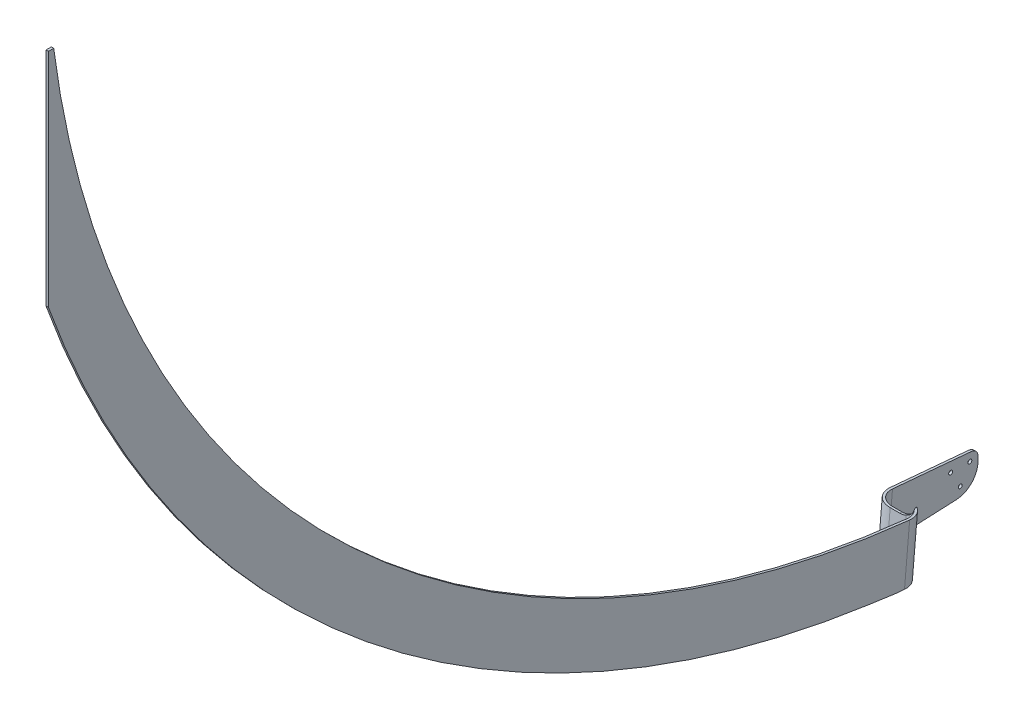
ISO-10303-21;
HEADER;
FILE_DESCRIPTION(('STEP AP214'),'2;1');
FILE_NAME('part.step','',(''),(''),'','','');
FILE_SCHEMA(('AUTOMOTIVE_DESIGN { 1 0 10303 214 1 1 1 1 }'));
ENDSEC;
DATA;
#1=APPLICATION_CONTEXT('core data for automotive mechanical design processes');
#2=APPLICATION_PROTOCOL_DEFINITION('international standard','automotive_design',2000,#1);
#3=PRODUCT_CONTEXT('',#1,'mechanical');
#4=PRODUCT('Part','Part','',(#3));
#5=PRODUCT_RELATED_PRODUCT_CATEGORY('part','',(#4));
#6=PRODUCT_DEFINITION_FORMATION('','',#4);
#7=PRODUCT_DEFINITION_CONTEXT('part definition',#1,'design');
#8=PRODUCT_DEFINITION('design','',#6,#7);
#9=PRODUCT_DEFINITION_SHAPE('','',#8);
#10=(LENGTH_UNIT() NAMED_UNIT(*) SI_UNIT(.MILLI.,.METRE.));
#11=(NAMED_UNIT(*) PLANE_ANGLE_UNIT() SI_UNIT($,.RADIAN.));
#12=(NAMED_UNIT(*) SI_UNIT($,.STERADIAN.) SOLID_ANGLE_UNIT());
#13=UNCERTAINTY_MEASURE_WITH_UNIT(LENGTH_MEASURE(1.E-05),#10,'distance_accuracy_value','');
#14=(GEOMETRIC_REPRESENTATION_CONTEXT(3) GLOBAL_UNCERTAINTY_ASSIGNED_CONTEXT((#13)) GLOBAL_UNIT_ASSIGNED_CONTEXT((#10,
#11,#12)) REPRESENTATION_CONTEXT('',''));
#15=CARTESIAN_POINT('',(0.,0.,0.));
#16=DIRECTION('',(0.,0.,1.));
#17=DIRECTION('',(1.,0.,0.));
#18=AXIS2_PLACEMENT_3D('',#15,#16,#17);
#19=CARTESIAN_POINT('',(-70.1674999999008,-19.1045489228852,588.065200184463));
#20=DIRECTION('',(-1.,0.,-3.20341386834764E-12));
#21=DIRECTION('',(-3.20341386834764E-12,0.,1.));
#22=AXIS2_PLACEMENT_3D('',#19,#20,#21);
#23=PLANE('',#22);
#24=CARTESIAN_POINT('',(-70.1674999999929,-60.9845452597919,498.417800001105));
#25=DIRECTION('',(1.,0.,3.20341386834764E-12));
#26=DIRECTION('',(3.20341386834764E-12,0.,-1.));
#27=AXIS2_PLACEMENT_3D('',#24,#25,#26);
#28=CIRCLE('',#27,2.59080000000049);
#29=CARTESIAN_POINT('',(-70.1674999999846,-60.9845452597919,495.827000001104));
#30=VERTEX_POINT('',#29);
#31=EDGE_CURVE('E424',#30,#30,#28,.T.);
#32=ORIENTED_EDGE('',*,*,#31,.T.);
#33=EDGE_LOOP('',(#32));
#34=FACE_BOUND('',#33,.T.);
#35=CARTESIAN_POINT('',(-70.1674999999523,-38.9875000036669,485.717800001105));
#36=DIRECTION('',(1.,0.,3.20341386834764E-12));
#37=DIRECTION('',(3.20341386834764E-12,0.,-1.));
#38=AXIS2_PLACEMENT_3D('',#35,#36,#37);
#39=CIRCLE('',#38,2.59079999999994);
#40=CARTESIAN_POINT('',(-70.1674999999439,-38.9875000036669,483.127000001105));
#41=VERTEX_POINT('',#40);
#42=EDGE_CURVE('E429',#41,#41,#39,.T.);
#43=ORIENTED_EDGE('',*,*,#42,.T.);
#44=EDGE_LOOP('',(#43));
#45=FACE_BOUND('',#44,.T.);
#46=CARTESIAN_POINT('',(-70.1675000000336,-38.9875000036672,511.117800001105));
#47=DIRECTION('',(1.,0.,3.20341386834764E-12));
#48=DIRECTION('',(3.20341386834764E-12,0.,-1.));
#49=AXIS2_PLACEMENT_3D('',#46,#47,#48);
#50=CIRCLE('',#49,2.59079999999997);
#51=CARTESIAN_POINT('',(-70.1675000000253,-38.9875000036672,508.527000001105));
#52=VERTEX_POINT('',#51);
#53=EDGE_CURVE('E423',#52,#52,#50,.T.);
#54=ORIENTED_EDGE('',*,*,#53,.T.);
#55=EDGE_LOOP('',(#54));
#56=FACE_BOUND('',#55,.T.);
#57=DIRECTION('',(0.,1.,0.));
#58=VECTOR('',#57,1.);
#59=CARTESIAN_POINT('',(-70.1674999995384,-29.2277234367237,474.91714965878));
#60=LINE('',#59,#58);
#61=CARTESIAN_POINT('',(-70.1674999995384,-43.8019392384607,474.91714965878));
#62=VERTEX_POINT('',#61);
#63=CARTESIAN_POINT('',(-70.1674999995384,-37.9385828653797,474.91714965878));
#64=VERTEX_POINT('',#63);
#65=EDGE_CURVE('E403',#62,#64,#60,.T.);
#66=ORIENTED_EDGE('',*,*,#65,.F.);
#67=CARTESIAN_POINT('',(-70.1674999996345,-43.8019392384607,504.917149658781));
#68=DIRECTION('',(-1.,0.,-3.20341386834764E-12));
#69=DIRECTION('',(-3.20341386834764E-12,0.,1.));
#70=AXIS2_PLACEMENT_3D('',#67,#68,#69);
#71=CIRCLE('',#70,30.);
#72=CARTESIAN_POINT('',(-70.1675000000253,-73.7707151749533,503.54876781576));
#73=VERTEX_POINT('',#72);
#74=EDGE_CURVE('E400',#62,#73,#71,.T.);
#75=ORIENTED_EDGE('',*,*,#74,.T.);
#76=DIRECTION('',(0.,-0.0456127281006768,0.998959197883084));
#77=VECTOR('',#76,1.);
#78=CARTESIAN_POINT('',(-70.1675000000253,-77.8698216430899,593.322834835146));
#79=LINE('',#78,#77);
#80=CARTESIAN_POINT('',(-70.1675000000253,-77.8698216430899,593.322834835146));
#81=VERTEX_POINT('',#80);
#82=EDGE_CURVE('E401',#73,#81,#79,.T.);
#83=ORIENTED_EDGE('',*,*,#82,.T.);
#84=DIRECTION('',(-2.85461334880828E-13,-0.996021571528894,0.0891124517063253));
#85=VECTOR('',#84,1.);
#86=CARTESIAN_POINT('',(-70.1674999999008,-19.1045489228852,588.065200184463));
#87=LINE('',#86,#85);
#88=CARTESIAN_POINT('',(-70.1674999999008,-19.1045489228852,588.065200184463));
#89=VERTEX_POINT('',#88);
#90=EDGE_CURVE('E497',#89,#81,#87,.T.);
#91=ORIENTED_EDGE('',*,*,#90,.F.);
#92=DIRECTION('',(3.19066955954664E-12,-0.0891124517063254,-0.996021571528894));
#93=VECTOR('',#92,1.);
#94=CARTESIAN_POINT('',(-70.1674999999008,-19.1045489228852,588.065200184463));
#95=LINE('',#94,#93);
#96=CARTESIAN_POINT('',(-70.1674999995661,-28.451477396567,483.593353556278));
#97=VERTEX_POINT('',#96);
#98=EDGE_CURVE('E375',#89,#97,#95,.T.);
#99=ORIENTED_EDGE('',*,*,#98,.T.);
#100=CARTESIAN_POINT('',(-70.1674999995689,-37.9385828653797,484.442149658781));
#101=DIRECTION('',(-1.,0.,-3.20341386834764E-12));
#102=DIRECTION('',(-3.20341386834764E-12,0.,1.));
#103=AXIS2_PLACEMENT_3D('',#100,#101,#102);
#104=CIRCLE('',#103,9.525);
#105=EDGE_CURVE('E378',#97,#64,#104,.T.);
#106=ORIENTED_EDGE('',*,*,#105,.T.);
#107=EDGE_LOOP('',(#66,#75,#83,#91,#99,#106));
#108=FACE_BOUND('',#107,.T.);
#109=ADVANCED_FACE('F50',(#34,#45,#56,#108),#23,.T.);
#110=CARTESIAN_POINT('',(1.5875,1274.52,498.24));
#111=DIRECTION('',(-1.,0.,0.));
#112=DIRECTION('',(0.,0.,1.));
#113=AXIS2_PLACEMENT_3D('',#110,#111,#112);
#114=CYLINDRICAL_SURFACE('',#113,1355.4825);
#115=CARTESIAN_POINT('',(1.5875,1274.52,498.24));
#116=DIRECTION('',(1.,0.,0.));
#117=DIRECTION('',(0.,0.,-1.));
#118=AXIS2_PLACEMENT_3D('',#115,#116,#117);
#119=CIRCLE('',#118,1355.4825);
#120=CARTESIAN_POINT('',(1.5875,816.089728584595,1773.8475));
#121=VERTEX_POINT('',#120);
#122=CARTESIAN_POINT('',(1.58749999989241,-67.8672297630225,686.20098844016));
#123=VERTEX_POINT('',#122);
#124=EDGE_CURVE('E202',#121,#123,#119,.T.);
#125=ORIENTED_EDGE('',*,*,#124,.F.);
#126=DIRECTION('',(-1.,0.,0.));
#127=VECTOR('',#126,1.);
#128=CARTESIAN_POINT('',(1.5875,816.089728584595,1773.8475));
#129=LINE('',#128,#127);
#130=CARTESIAN_POINT('',(-1.5875,816.089728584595,1773.8475));
#131=VERTEX_POINT('',#130);
#132=EDGE_CURVE('E571',#121,#131,#129,.T.);
#133=ORIENTED_EDGE('',*,*,#132,.T.);
#134=CARTESIAN_POINT('',(-1.5875,1274.52,498.24));
#135=DIRECTION('',(1.,0.,0.));
#136=DIRECTION('',(0.,0.,-1.));
#137=AXIS2_PLACEMENT_3D('',#134,#135,#136);
#138=CIRCLE('',#137,1355.4825);
#139=CARTESIAN_POINT('',(-1.5875,-67.8672297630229,686.20098844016));
#140=VERTEX_POINT('',#139);
#141=EDGE_CURVE('E205',#131,#140,#138,.T.);
#142=ORIENTED_EDGE('',*,*,#141,.T.);
#143=DIRECTION('',(-1.,0.,0.));
#144=VECTOR('',#143,1.);
#145=CARTESIAN_POINT('',(1.58749999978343,-67.8672297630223,686.20098844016));
#146=LINE('',#145,#144);
#147=EDGE_CURVE('E206',#140,#123,#146,.F.);
#148=ORIENTED_EDGE('',*,*,#147,.T.);
#149=EDGE_LOOP('',(#125,#133,#142,#148));
#150=FACE_BOUND('',#149,.T.);
#151=ADVANCED_FACE('F241',(#150),#114,.T.);
#152=CARTESIAN_POINT('',(1.5875,1274.52,498.24));
#153=DIRECTION('',(-1.,0.,0.));
#154=DIRECTION('',(0.,0.,1.));
#155=AXIS2_PLACEMENT_3D('',#152,#153,#154);
#156=CYLINDRICAL_SURFACE('',#155,1279.2825);
#157=CARTESIAN_POINT('',(-1.5875,1274.52,498.24));
#158=DIRECTION('',(-1.,0.,0.));
#159=DIRECTION('',(0.,0.,-1.));
#160=AXIS2_PLACEMENT_3D('',#157,#158,#159);
#161=CIRCLE('',#160,1279.2825);
#162=CARTESIAN_POINT('',(-1.5875,2.45627283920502,633.951417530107));
#163=VERTEX_POINT('',#162);
#164=CARTESIAN_POINT('',(-1.58750000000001,1109.59963815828,1766.8475));
#165=VERTEX_POINT('',#164);
#166=EDGE_CURVE('E193',#163,#165,#161,.T.);
#167=ORIENTED_EDGE('',*,*,#166,.T.);
#168=DIRECTION('',(1.,0.,0.));
#169=VECTOR('',#168,1.);
#170=CARTESIAN_POINT('',(-70.1675000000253,1109.59963815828,1766.8475));
#171=LINE('',#170,#169);
#172=CARTESIAN_POINT('',(1.58750000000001,1109.59963815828,1766.8475));
#173=VERTEX_POINT('',#172);
#174=EDGE_CURVE('E177',#165,#173,#171,.T.);
#175=ORIENTED_EDGE('',*,*,#174,.T.);
#176=CARTESIAN_POINT('',(1.5875,1274.52,498.24));
#177=DIRECTION('',(-1.,0.,0.));
#178=DIRECTION('',(0.,0.,-1.));
#179=AXIS2_PLACEMENT_3D('',#176,#177,#178);
#180=CIRCLE('',#179,1279.2825);
#181=CARTESIAN_POINT('',(1.5875,2.45627283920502,633.951417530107));
#182=VERTEX_POINT('',#181);
#183=EDGE_CURVE('E207',#182,#173,#180,.T.);
#184=ORIENTED_EDGE('',*,*,#183,.F.);
#185=CARTESIAN_POINT('',(1.5875,2.45627283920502,633.951417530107));
#186=CARTESIAN_POINT('',(1.58749974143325,2.41836116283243,633.596061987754));
#187=CARTESIAN_POINT('',(1.57995882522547,2.3806034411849,633.240733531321));
#188=CARTESIAN_POINT('',(1.54981445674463,2.30545215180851,632.530678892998));
#189=CARTESIAN_POINT('',(1.52721106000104,2.26805858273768,632.175952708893));
#190=CARTESIAN_POINT('',(1.43685148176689,2.15652810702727,631.113686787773));
#191=CARTESIAN_POINT('',(1.34654588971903,2.0830209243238,630.407867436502));
#192=CARTESIAN_POINT('',(1.10664826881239,1.93834180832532,629.007476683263));
#193=CARTESIAN_POINT('',(0.957157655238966,1.86716610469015,628.312888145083));
#194=CARTESIAN_POINT('',(0.599957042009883,1.72745347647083,626.938583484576));
#195=CARTESIAN_POINT('',(0.392247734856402,1.65891652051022,626.258867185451));
#196=CARTESIAN_POINT('',(-0.0801627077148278,1.52482251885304,624.918517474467));
#197=CARTESIAN_POINT('',(-0.344909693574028,1.45926792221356,624.257899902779));
#198=CARTESIAN_POINT('',(-0.783155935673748,1.3635117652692,623.285502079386));
#199=CARTESIAN_POINT('',(-0.936101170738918,1.33202079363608,622.964441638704));
#200=CARTESIAN_POINT('',(-1.25548890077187,1.26992321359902,622.328914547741));
#201=CARTESIAN_POINT('',(-1.42193478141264,1.23931682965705,622.014449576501));
#202=CARTESIAN_POINT('',(-1.94102326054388,1.14890010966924,621.081957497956));
#203=CARTESIAN_POINT('',(-2.313481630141,1.09047803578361,620.474689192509));
#204=CARTESIAN_POINT('',(-3.10849065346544,0.977647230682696,619.293470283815));
#205=CARTESIAN_POINT('',(-3.53104249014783,0.92323859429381,618.719520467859));
#206=CARTESIAN_POINT('',(-4.21370018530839,0.843228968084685,617.869784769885));
#207=CARTESIAN_POINT('',(-4.45697298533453,0.816092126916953,617.580483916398));
#208=CARTESIAN_POINT('',(-4.95620321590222,0.763054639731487,617.013061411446));
#209=CARTESIAN_POINT('',(-5.21215736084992,0.737153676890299,616.734936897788));
#210=CARTESIAN_POINT('',(-5.99846245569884,0.66133216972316,615.91798549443));
#211=CARTESIAN_POINT('',(-6.54727640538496,0.613290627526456,615.396555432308));
#212=CARTESIAN_POINT('',(-7.69078398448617,0.522352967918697,614.403503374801));
#213=CARTESIAN_POINT('',(-8.28557595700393,0.479468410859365,613.931993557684));
#214=CARTESIAN_POINT('',(-9.20760484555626,0.419225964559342,613.266006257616));
#215=CARTESIAN_POINT('',(-9.51996119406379,0.399823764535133,613.050866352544));
#216=CARTESIAN_POINT('',(-10.1540488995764,0.362394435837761,612.634731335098));
#217=CARTESIAN_POINT('',(-10.4757804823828,0.344367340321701,612.433736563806));
#218=CARTESIAN_POINT('',(-10.801916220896,0.327033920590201,612.24));
#219=B_SPLINE_CURVE_WITH_KNOTS('',3,(#185,#186,#187,#188,#189,#190,#191,#192,#193,#194,#195,
#196,#197,#198,#199,#200,#201,#202,#203,#204,#205,#206,#207,#208,#209,#210,#211,#212,#213,#214,
#215,#216,#217,#218),.UNSPECIFIED.,.F.,.F.,(4,2,2,2,2,2,2,2,2,2,2,2,2,2,2,2,4),(0.,
1.07195047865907,2.14389700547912,4.28721191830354,6.42686998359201,8.56650259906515,
10.7078616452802,11.7786505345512,12.8497087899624,14.9913509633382,17.13304372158,
18.2695935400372,19.4058504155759,21.6782668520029,23.95568595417,25.0946732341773,
26.2336879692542),.UNSPECIFIED.);
#220=CARTESIAN_POINT('',(-10.801916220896,0.327033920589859,612.24));
#221=VERTEX_POINT('',#220);
#222=EDGE_CURVE('E511',#182,#221,#219,.T.);
#223=ORIENTED_EDGE('',*,*,#222,.T.);
#224=CARTESIAN_POINT('',(-10.801916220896,0.327033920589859,612.24));
#225=CARTESIAN_POINT('',(-10.7543234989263,0.357183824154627,612.577004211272));
#226=CARTESIAN_POINT('',(-10.6922039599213,0.38728778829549,612.911959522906));
#227=CARTESIAN_POINT('',(-10.5395288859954,0.447170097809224,613.575375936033));
#228=CARTESIAN_POINT('',(-10.4489717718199,0.476948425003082,613.903836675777));
#229=CARTESIAN_POINT('',(-10.2426835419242,0.535197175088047,614.543644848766));
#230=CARTESIAN_POINT('',(-10.127646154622,0.563681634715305,614.855214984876));
#231=CARTESIAN_POINT('',(-9.87196520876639,0.619894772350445,615.467689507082));
#232=CARTESIAN_POINT('',(-9.7313261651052,0.647623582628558,615.76859576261));
#233=CARTESIAN_POINT('',(-9.4515330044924,0.697459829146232,616.307401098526));
#234=CARTESIAN_POINT('',(-9.31621974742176,0.719719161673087,616.547290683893));
#235=CARTESIAN_POINT('',(-9.02929783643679,0.763449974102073,617.01719371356));
#236=CARTESIAN_POINT('',(-8.87768972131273,0.78492148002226,617.247207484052));
#237=CARTESIAN_POINT('',(-8.55547427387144,0.827408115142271,617.701078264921));
#238=CARTESIAN_POINT('',(-8.38452909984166,0.848403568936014,617.924697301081));
#239=CARTESIAN_POINT('',(-8.02722462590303,0.889328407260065,618.359419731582));
#240=CARTESIAN_POINT('',(-7.84086307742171,0.909257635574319,618.570521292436));
#241=CARTESIAN_POINT('',(-7.64723894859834,0.928590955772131,618.774798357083));
#242=B_SPLINE_CURVE_WITH_KNOTS('',3,(#224,#225,#226,#227,#228,#229,#230,#231,#232,#233,#234,
#235,#236,#237,#238,#239,#240,#241),.UNSPECIFIED.,.F.,.F.,(4,2,2,2,2,2,2,2,4),(0.,
1.0247336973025,2.04952431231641,3.04842693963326,4.0471535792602,4.87547642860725,
5.7037718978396,6.5498385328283,7.39602879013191),.UNSPECIFIED.);
#243=CARTESIAN_POINT('',(-7.64723894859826,0.928590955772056,618.774798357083));
#244=VERTEX_POINT('',#243);
#245=EDGE_CURVE('E518',#221,#244,#242,.T.);
#246=ORIENTED_EDGE('',*,*,#245,.T.);
#247=CARTESIAN_POINT('',(-19.5620982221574,0.327033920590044,612.24));
#248=CARTESIAN_POINT('',(-19.2553567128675,0.33235989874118,612.299527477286));
#249=CARTESIAN_POINT('',(-18.9499101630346,0.338265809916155,612.365493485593));
#250=CARTESIAN_POINT('',(-18.3420879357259,0.35123410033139,612.510189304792));
#251=CARTESIAN_POINT('',(-18.0397121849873,0.358296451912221,612.58891881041));
#252=CARTESIAN_POINT('',(-17.138045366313,0.381209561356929,612.844043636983));
#253=CARTESIAN_POINT('',(-16.5440563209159,0.398789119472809,613.03940603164));
#254=CARTESIAN_POINT('',(-15.3749364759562,0.438492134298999,613.479206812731));
#255=CARTESIAN_POINT('',(-14.7997989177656,0.460613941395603,613.723627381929));
#256=CARTESIAN_POINT('',(-13.9542851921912,0.497142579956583,614.125683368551));
#257=CARTESIAN_POINT('',(-13.675301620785,0.509877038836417,614.265612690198));
#258=CARTESIAN_POINT('',(-13.1234311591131,0.536455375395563,614.557084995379));
#259=CARTESIAN_POINT('',(-12.8505458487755,0.55029953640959,614.708630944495));
#260=CARTESIAN_POINT('',(-12.0417509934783,0.593481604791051,615.180328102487));
#261=CARTESIAN_POINT('',(-11.5157455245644,0.624467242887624,615.517518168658));
#262=CARTESIAN_POINT('',(-10.4941470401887,0.690707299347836,616.234819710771));
#263=CARTESIAN_POINT('',(-9.9985540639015,0.72596172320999,616.614931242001));
#264=CARTESIAN_POINT('',(-9.28078178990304,0.781924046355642,617.215077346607));
#265=CARTESIAN_POINT('',(-9.04580426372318,0.80109063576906,617.420112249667));
#266=CARTESIAN_POINT('',(-8.58479618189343,0.840429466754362,617.839794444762));
#267=CARTESIAN_POINT('',(-8.35876330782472,0.860601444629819,618.054439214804));
#268=CARTESIAN_POINT('',(-7.69457086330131,0.922604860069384,618.71233658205));
#269=CARTESIAN_POINT('',(-7.27027180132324,0.965927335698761,619.169590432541));
#270=CARTESIAN_POINT('',(-6.46191047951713,1.05633684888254,620.117972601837));
#271=CARTESIAN_POINT('',(-6.07784515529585,1.1034235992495,620.609098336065));
#272=CARTESIAN_POINT('',(-5.53402439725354,1.17669575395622,621.368425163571));
#273=CARTESIAN_POINT('',(-5.3581233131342,1.20156129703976,621.625318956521));
#274=CARTESIAN_POINT('',(-5.0173065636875,1.25215268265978,622.146304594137));
#275=CARTESIAN_POINT('',(-4.85239370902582,1.27787874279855,622.410398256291));
#276=CARTESIAN_POINT('',(-4.37454864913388,1.35630901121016,623.212875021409));
#277=CARTESIAN_POINT('',(-4.07857747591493,1.41025621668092,623.761359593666));
#278=CARTESIAN_POINT('',(-3.5341360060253,1.52115745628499,624.881139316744));
#279=CARTESIAN_POINT('',(-3.28566720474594,1.5781115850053,625.452435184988));
#280=CARTESIAN_POINT('',(-2.94042897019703,1.66801922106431,626.347963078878));
#281=CARTESIAN_POINT('',(-2.82625651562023,1.70003462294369,626.665675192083));
#282=CARTESIAN_POINT('',(-2.61266237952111,1.76479005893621,627.305850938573));
#283=CARTESIAN_POINT('',(-2.51323690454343,1.79752990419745,627.628313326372));
#284=CARTESIAN_POINT('',(-2.2373347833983,1.89677423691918,628.602054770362));
#285=CARTESIAN_POINT('',(-2.08322511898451,1.96430542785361,629.259707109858));
#286=CARTESIAN_POINT('',(-1.83593850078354,2.10165885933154,630.586989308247));
#287=CARTESIAN_POINT('',(-1.74283752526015,2.17148384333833,631.256633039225));
#288=CARTESIAN_POINT('',(-1.64967114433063,2.27744894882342,632.265074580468));
#289=CARTESIAN_POINT('',(-1.62636319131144,2.31297953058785,632.601924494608));
#290=CARTESIAN_POINT('',(-1.59527716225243,2.38438447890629,633.276312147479));
#291=CARTESIAN_POINT('',(-1.58749946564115,2.42025885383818,633.613849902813));
#292=CARTESIAN_POINT('',(-1.5875,2.45627283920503,633.951417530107));
#293=B_SPLINE_CURVE_WITH_KNOTS('',3,(#247,#248,#249,#250,#251,#252,#253,#254,#255,#256,#257,
#258,#259,#260,#261,#262,#263,#264,#265,#266,#267,#268,#269,#270,#271,#272,#273,#274,#275,#276,
#277,#278,#279,#280,#281,#282,#283,#284,#285,#286,#287,#288,#289,#290,#291,#292),.UNSPECIFIED.,
.F.,.F.,(4,2,2,2,2,2,2,2,2,2,2,2,2,2,2,2,2,2,2,2,2,2,4),(0.,0.937389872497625,1.87475732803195,
3.74900963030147,5.62258245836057,6.55944578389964,7.49654908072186,9.37089816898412,
11.245249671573,12.1823379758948,13.11918177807,14.9926910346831,16.8660574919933,
17.8028232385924,18.7398276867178,20.6141844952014,22.4886002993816,23.5056352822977,
24.5224081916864,26.5558928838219,28.5919052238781,29.6101522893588,30.6284242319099),.UNSPECIFIED.);
#294=EDGE_CURVE('E197',#244,#163,#293,.T.);
#295=ORIENTED_EDGE('',*,*,#294,.T.);
#296=EDGE_LOOP('',(#167,#175,#184,#223,#246,#295));
#297=FACE_BOUND('',#296,.T.);
#298=ADVANCED_FACE('F200',(#297),#156,.F.);
#299=CARTESIAN_POINT('',(1.5875,1274.52,498.24));
#300=DIRECTION('',(1.,0.,0.));
#301=DIRECTION('',(0.,0.,-1.));
#302=AXIS2_PLACEMENT_3D('',#299,#300,#301);
#303=PLANE('',#302);
#304=DIRECTION('',(0.,0.,-1.));
#305=VECTOR('',#304,1.);
#306=CARTESIAN_POINT('',(1.5875,1109.59963815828,498.24));
#307=LINE('',#306,#305);
#308=CARTESIAN_POINT('',(1.58750000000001,1109.59963815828,1773.8475));
#309=VERTEX_POINT('',#308);
#310=EDGE_CURVE('E182',#309,#173,#307,.T.);
#311=ORIENTED_EDGE('',*,*,#310,.F.);
#312=DIRECTION('',(0.,1.,0.));
#313=VECTOR('',#312,1.);
#314=CARTESIAN_POINT('',(1.5875,1274.52,1773.8475));
#315=LINE('',#314,#313);
#316=EDGE_CURVE('E568',#121,#309,#315,.T.);
#317=ORIENTED_EDGE('',*,*,#316,.F.);
#318=ORIENTED_EDGE('',*,*,#124,.T.);
#319=DIRECTION('',(0.,0.138667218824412,0.990339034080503));
#320=VECTOR('',#319,1.);
#321=CARTESIAN_POINT('',(1.5875,-67.8672297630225,686.20098844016));
#322=LINE('',#321,#320);
#323=CARTESIAN_POINT('',(1.58750000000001,-72.5563899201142,652.711758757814));
#324=VERTEX_POINT('',#323);
#325=EDGE_CURVE('E451',#324,#123,#322,.T.);
#326=ORIENTED_EDGE('',*,*,#325,.F.);
#327=DIRECTION('',(-3.19063905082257E-12,0.0891124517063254,0.996021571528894));
#328=VECTOR('',#327,1.);
#329=CARTESIAN_POINT('',(1.58749999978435,-69.5467186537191,686.351249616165));
#330=LINE('',#329,#328);
#331=CARTESIAN_POINT('',(1.5874999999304,-73.6258411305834,640.758362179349));
#332=VERTEX_POINT('',#331);
#333=EDGE_CURVE('E459',#332,#324,#330,.T.);
#334=ORIENTED_EDGE('',*,*,#333,.F.);
#335=DIRECTION('',(0.,-0.996021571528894,0.0891124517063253));
#336=VECTOR('',#335,1.);
#337=CARTESIAN_POINT('',(1.5875,1276.46396869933,519.96799335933));
#338=LINE('',#337,#336);
#339=EDGE_CURVE('E512',#332,#182,#338,.F.);
#340=ORIENTED_EDGE('',*,*,#339,.T.);
#341=ORIENTED_EDGE('',*,*,#183,.T.);
#342=EDGE_LOOP('',(#311,#317,#318,#326,#334,#340,#341));
#343=FACE_BOUND('',#342,.T.);
#344=ADVANCED_FACE('F343',(#343),#303,.T.);
#345=CARTESIAN_POINT('',(-1.5875,1274.52,498.24));
#346=DIRECTION('',(1.,0.,0.));
#347=DIRECTION('',(0.,0.,-1.));
#348=AXIS2_PLACEMENT_3D('',#345,#346,#347);
#349=PLANE('',#348);
#350=DIRECTION('',(0.,1.,0.));
#351=VECTOR('',#350,1.);
#352=CARTESIAN_POINT('',(-1.5875,1274.52,1773.8475));
#353=LINE('',#352,#351);
#354=CARTESIAN_POINT('',(-1.5875,1109.59963815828,1773.8475));
#355=VERTEX_POINT('',#354);
#356=EDGE_CURVE('E57',#131,#355,#353,.T.);
#357=ORIENTED_EDGE('',*,*,#356,.T.);
#358=DIRECTION('',(0.,0.,-1.));
#359=VECTOR('',#358,1.);
#360=CARTESIAN_POINT('',(-1.5875,1109.59963815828,498.24));
#361=LINE('',#360,#359);
#362=EDGE_CURVE('E11',#355,#165,#361,.T.);
#363=ORIENTED_EDGE('',*,*,#362,.T.);
#364=ORIENTED_EDGE('',*,*,#166,.F.);
#365=DIRECTION('',(0.,-0.996021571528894,0.0891124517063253));
#366=VECTOR('',#365,1.);
#367=CARTESIAN_POINT('',(-1.5875,1276.46396869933,519.96799335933));
#368=LINE('',#367,#366);
#369=CARTESIAN_POINT('',(-1.5875000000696,-73.6258411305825,640.758362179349));
#370=VERTEX_POINT('',#369);
#371=EDGE_CURVE('E212',#163,#370,#368,.T.);
#372=ORIENTED_EDGE('',*,*,#371,.T.);
#373=DIRECTION('',(3.19064117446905E-12,-0.0891124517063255,-0.996021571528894));
#374=VECTOR('',#373,1.);
#375=CARTESIAN_POINT('',(-1.58750000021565,-69.5467186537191,686.351249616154));
#376=LINE('',#375,#374);
#377=CARTESIAN_POINT('',(-1.58750000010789,-72.556389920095,652.711758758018));
#378=VERTEX_POINT('',#377);
#379=EDGE_CURVE('E455',#378,#370,#376,.T.);
#380=ORIENTED_EDGE('',*,*,#379,.F.);
#381=DIRECTION('',(0.,0.138667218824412,0.990339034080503));
#382=VECTOR('',#381,1.);
#383=CARTESIAN_POINT('',(-1.5875,-67.8672297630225,686.20098844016));
#384=LINE('',#383,#382);
#385=EDGE_CURVE('E450',#378,#140,#384,.T.);
#386=ORIENTED_EDGE('',*,*,#385,.T.);
#387=ORIENTED_EDGE('',*,*,#141,.F.);
#388=EDGE_LOOP('',(#357,#363,#364,#372,#380,#386,#387));
#389=FACE_BOUND('',#388,.T.);
#390=ADVANCED_FACE('F192',(#389),#349,.F.);
#391=CARTESIAN_POINT('',(-44.7674999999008,-19.1045489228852,588.065200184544));
#392=DIRECTION('',(-2.85461334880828E-13,-0.996021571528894,0.0891124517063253));
#393=DIRECTION('',(0.,-0.0891124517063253,-0.996021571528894));
#394=AXIS2_PLACEMENT_3D('',#391,#392,#393);
#395=PLANE('',#394);
#396=DIRECTION('',(-3.19066955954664E-12,0.0891124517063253,0.996021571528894));
#397=VECTOR('',#396,1.);
#398=CARTESIAN_POINT('',(-66.9924999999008,-19.1045489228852,588.065200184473));
#399=LINE('',#398,#397);
#400=CARTESIAN_POINT('',(-66.9924999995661,-28.451477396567,483.593353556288));
#401=VERTEX_POINT('',#400);
#402=CARTESIAN_POINT('',(-66.9924999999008,-19.1045489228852,588.065200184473));
#403=VERTEX_POINT('',#402);
#404=EDGE_CURVE('E359',#401,#403,#399,.T.);
#405=ORIENTED_EDGE('',*,*,#404,.F.);
#406=DIRECTION('',(1.,0.,3.20341386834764E-12));
#407=VECTOR('',#406,1.);
#408=CARTESIAN_POINT('',(-70.1674999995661,-28.451477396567,483.593353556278));
#409=LINE('',#408,#407);
#410=EDGE_CURVE('E361',#401,#97,#409,.F.);
#411=ORIENTED_EDGE('',*,*,#410,.T.);
#412=ORIENTED_EDGE('',*,*,#98,.F.);
#413=CARTESIAN_POINT('',(-44.7674999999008,-19.1045489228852,588.065200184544));
#414=DIRECTION('',(-2.85461334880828E-13,-0.996021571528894,0.0891124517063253));
#415=DIRECTION('',(0.,-0.0891124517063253,-0.996021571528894));
#416=AXIS2_PLACEMENT_3D('',#413,#414,#415);
#417=CIRCLE('',#416,25.4);
#418=CARTESIAN_POINT('',(-44.7674999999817,-16.8410926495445,613.364148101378));
#419=VERTEX_POINT('',#418);
#420=EDGE_CURVE('E457',#419,#89,#417,.T.);
#421=ORIENTED_EDGE('',*,*,#420,.F.);
#422=DIRECTION('',(-1.,0.,-3.20365421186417E-12));
#423=VECTOR('',#422,1.);
#424=CARTESIAN_POINT('',(-1.58749999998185,-16.8410926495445,613.364148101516));
#425=LINE('',#424,#423);
#426=CARTESIAN_POINT('',(-32.3653740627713,-16.8410926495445,613.364148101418));
#427=VERTEX_POINT('',#426);
#428=EDGE_CURVE('E456',#427,#419,#425,.T.);
#429=ORIENTED_EDGE('',*,*,#428,.F.);
#430=CARTESIAN_POINT('',(-10.6094777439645,-0.0559072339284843,607.875630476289));
#431=CARTESIAN_POINT('',(-14.3517660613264,-17.2719448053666,608.548456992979));
#432=CARTESIAN_POINT('',(-31.5307689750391,-17.6253880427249,604.597975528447));
#433=CARTESIAN_POINT('',(-10.6285466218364,-0.0488532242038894,607.957637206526));
#434=CARTESIAN_POINT('',(-14.3770783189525,-17.2622691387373,608.65660318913));
#435=CARTESIAN_POINT('',(-31.5837326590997,-17.6049453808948,604.826465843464));
#436=CARTESIAN_POINT('',(-10.6467507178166,-0.0417716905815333,608.039871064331));
#437=CARTESIAN_POINT('',(-14.4012440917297,-17.2525674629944,608.765040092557));
#438=CARTESIAN_POINT('',(-31.6342762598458,-17.5844535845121,605.055505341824));
#439=CARTESIAN_POINT('',(-10.6814142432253,-0.027560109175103,608.204714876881));
#440=CARTESIAN_POINT('',(-14.4472657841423,-17.2331193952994,608.982413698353));
#441=CARTESIAN_POINT('',(-31.7305042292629,-17.5433795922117,605.514594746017));
#442=CARTESIAN_POINT('',(-10.6978736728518,-0.0204300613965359,608.287324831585));
#443=CARTESIAN_POINT('',(-14.4691217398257,-17.2233729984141,609.09135045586));
#444=CARTESIAN_POINT('',(-31.7761885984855,-17.5227973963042,605.744644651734));
#445=CARTESIAN_POINT('',(-10.7446104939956,0.00102221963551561,608.535591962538));
#446=CARTESIAN_POINT('',(-14.5311973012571,-17.1940787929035,609.418775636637));
#447=CARTESIAN_POINT('',(-31.9059192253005,-17.46092941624,606.436151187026));
#448=CARTESIAN_POINT('',(-10.7722486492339,0.0154074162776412,608.701696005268));
#449=CARTESIAN_POINT('',(-14.5679283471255,-17.1744745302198,609.637895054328));
#450=CARTESIAN_POINT('',(-31.9826491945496,-17.4195198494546,606.898991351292));
#451=CARTESIAN_POINT('',(-10.8204692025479,0.0443416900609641,609.035031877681));
#452=CARTESIAN_POINT('',(-14.6320399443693,-17.1351356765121,610.077590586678));
#453=CARTESIAN_POINT('',(-32.1164417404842,-17.336452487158,607.827446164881));
#454=CARTESIAN_POINT('',(-10.8410519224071,0.0588907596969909,609.202263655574));
#455=CARTESIAN_POINT('',(-14.6594211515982,-17.1154010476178,610.298167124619));
#456=CARTESIAN_POINT('',(-32.1735052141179,-17.2947947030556,608.293060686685));
#457=CARTESIAN_POINT('',(-10.8751008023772,0.0881077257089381,609.537326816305));
#458=CARTESIAN_POINT('',(-14.7047637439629,-17.0758533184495,610.740197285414));
#459=CARTESIAN_POINT('',(-32.2678757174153,-17.2113014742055,609.22627546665));
#460=CARTESIAN_POINT('',(-10.8885669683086,0.10277562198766,609.705158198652));
#461=CARTESIAN_POINT('',(-14.7227253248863,-17.0560401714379,610.961651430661));
#462=CARTESIAN_POINT('',(-32.305182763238,-17.1694660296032,609.693875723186));
#463=CARTESIAN_POINT('',(-10.9083690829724,0.132219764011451,610.041291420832));
#464=CARTESIAN_POINT('',(-14.7492006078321,-17.0163616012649,611.405144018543));
#465=CARTESIAN_POINT('',(-32.3599591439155,-17.0857082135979,610.63004782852));
#466=CARTESIAN_POINT('',(-10.9147077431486,0.146995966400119,610.209593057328));
#467=CARTESIAN_POINT('',(-14.7577180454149,-16.996496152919,611.627182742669));
#468=CARTESIAN_POINT('',(-32.3774360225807,-17.0437858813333,611.098619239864));
#469=CARTESIAN_POINT('',(-10.9202470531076,0.176615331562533,610.546194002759));
#470=CARTESIAN_POINT('',(-14.7652967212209,-16.9567586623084,612.071333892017));
#471=CARTESIAN_POINT('',(-32.3925508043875,-16.9599127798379,612.036079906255));
#472=CARTESIAN_POINT('',(-10.9194476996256,0.191458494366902,610.714493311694));
#473=CARTESIAN_POINT('',(-14.7643580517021,-16.9368865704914,612.293446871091));
#474=CARTESIAN_POINT('',(-32.3901886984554,-16.9179620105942,612.504969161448));
#475=CARTESIAN_POINT('',(-10.9107073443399,0.22120530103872,611.05101495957));
#476=CARTESIAN_POINT('',(-14.7530206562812,-16.897155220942,612.737529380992));
#477=CARTESIAN_POINT('',(-32.3656257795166,-16.8341071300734,613.442226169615));
#478=CARTESIAN_POINT('',(-10.9027664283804,0.23610894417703,611.219237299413));
#479=CARTESIAN_POINT('',(-14.7426220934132,-16.8772959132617,612.959499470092));
#480=CARTESIAN_POINT('',(-32.3434252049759,-16.7922030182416,613.91059392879));
#481=CARTESIAN_POINT('',(-10.879772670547,0.265928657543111,611.555068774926));
#482=CARTESIAN_POINT('',(-14.7123974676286,-16.8376432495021,613.40270249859));
#483=CARTESIAN_POINT('',(-32.2792291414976,-16.7085153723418,614.845981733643));
#484=CARTESIAN_POINT('',(-10.8647198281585,0.280844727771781,611.722677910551));
#485=CARTESIAN_POINT('',(-14.6925714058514,-16.8178498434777,613.623935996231));
#486=CARTESIAN_POINT('',(-32.2372336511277,-16.6667318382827,615.313001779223));
#487=CARTESIAN_POINT('',(-10.8274770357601,0.310705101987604,612.057466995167));
#488=CARTESIAN_POINT('',(-14.6434703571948,-16.7783188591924,614.065778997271));
#489=CARTESIAN_POINT('',(-32.1334448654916,-16.583301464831,616.245514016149));
#490=CARTESIAN_POINT('',(-10.8052771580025,0.325649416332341,612.224646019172));
#491=CARTESIAN_POINT('',(-14.6141821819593,-16.7585813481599,614.28638774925));
#492=CARTESIAN_POINT('',(-32.0716240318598,-16.5416548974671,616.711003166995));
#493=CARTESIAN_POINT('',(-10.7538203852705,0.355496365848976,612.557804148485));
#494=CARTESIAN_POINT('',(-14.5462487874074,-16.7192430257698,614.726077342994));
#495=CARTESIAN_POINT('',(-31.9283177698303,-16.4586312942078,617.63896888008));
#496=CARTESIAN_POINT('',(-10.7245634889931,0.370399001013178,612.723783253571));
#497=CARTESIAN_POINT('',(-14.5076034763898,-16.6996421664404,614.945158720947));
#498=CARTESIAN_POINT('',(-31.8468323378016,-16.4172542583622,618.101445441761));
#499=CARTESIAN_POINT('',(-10.6590103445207,0.400151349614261,613.054431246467));
#500=CARTESIAN_POINT('',(-14.4209967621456,-16.6605988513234,615.381550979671));
#501=CARTESIAN_POINT('',(-31.6643357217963,-16.3348430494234,619.02256634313));
#502=CARTESIAN_POINT('',(-10.6227140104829,0.415001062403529,613.219100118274));
#503=CARTESIAN_POINT('',(-14.3730351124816,-16.6411563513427,615.598862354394));
#504=CARTESIAN_POINT('',(-31.5633242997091,-16.2938088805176,619.481210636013));
#505=CARTESIAN_POINT('',(-10.5431973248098,0.444600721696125,613.546629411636));
#506=CARTESIAN_POINT('',(-14.2679260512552,-16.6024799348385,616.031153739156));
#507=CARTESIAN_POINT('',(-31.3419572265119,-16.2121568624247,620.393845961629));
#508=CARTESIAN_POINT('',(-10.499976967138,0.459350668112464,613.709489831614));
#509=CARTESIAN_POINT('',(-14.2107784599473,-16.583245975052,616.246134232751));
#510=CARTESIAN_POINT('',(-31.221601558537,-16.1715390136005,620.847836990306));
#511=CARTESIAN_POINT('',(-10.4066376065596,0.488740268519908,614.033308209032));
#512=CARTESIAN_POINT('',(-14.0873696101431,-16.545010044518,616.673502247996));
#513=CARTESIAN_POINT('',(-30.9618142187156,-16.0908095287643,621.7501610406));
#514=CARTESIAN_POINT('',(-10.3565215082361,0.503379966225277,614.194266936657));
#515=CARTESIAN_POINT('',(-14.0211119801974,-16.5260079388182,616.885891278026));
#516=CARTESIAN_POINT('',(-30.8223905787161,-16.0506976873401,622.198496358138));
#517=CARTESIAN_POINT('',(-10.2495127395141,0.532511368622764,614.513896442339));
#518=CARTESIAN_POINT('',(-13.8796252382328,-16.4882737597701,617.307651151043));
#519=CARTESIAN_POINT('',(-30.524677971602,-15.9710325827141,623.08892369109));
#520=CARTESIAN_POINT('',(-10.1926200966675,0.547003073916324,614.672567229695));
#521=CARTESIAN_POINT('',(-13.8043959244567,-16.4695416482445,617.517022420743));
#522=CARTESIAN_POINT('',(-30.3663890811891,-15.931479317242,623.53101573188));
#523=CARTESIAN_POINT('',(-10.1023438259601,0.568593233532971,614.90848012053));
#524=CARTESIAN_POINT('',(-13.6849857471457,-16.4416841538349,617.828389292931));
#525=CARTESIAN_POINT('',(-30.115026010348,-15.8726249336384,624.188838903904));
#526=CARTESIAN_POINT('',(-10.0714280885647,0.575765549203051,614.986770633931));
#527=CARTESIAN_POINT('',(-13.6440867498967,-16.43243817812,617.93173277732));
#528=CARTESIAN_POINT('',(-30.0289145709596,-15.8530856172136,624.407232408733));
#529=CARTESIAN_POINT('',(-10.0079158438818,0.590069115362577,615.142746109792));
#530=CARTESIAN_POINT('',(-13.5600779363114,-16.4140211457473,618.137582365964));
#531=CARTESIAN_POINT('',(-29.8520851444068,-15.8141736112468,624.842157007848));
#532=CARTESIAN_POINT('',(-9.97531936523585,0.597200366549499,615.220431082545));
#533=CARTESIAN_POINT('',(-13.5169681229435,-16.4048500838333,618.240088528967));
#534=CARTESIAN_POINT('',(-29.7613672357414,-15.7948009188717,625.058688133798));
#535=CARTESIAN_POINT('',(-9.875048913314,0.618521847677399,615.452467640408));
#536=CARTESIAN_POINT('',(-13.3843678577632,-16.3774593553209,618.546238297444));
#537=CARTESIAN_POINT('',(-29.4823625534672,-15.7369445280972,625.705356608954));
#538=CARTESIAN_POINT('',(-9.80489201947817,0.632640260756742,615.605805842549));
#539=CARTESIAN_POINT('',(-13.2916047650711,-16.3593617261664,618.748517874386));
#540=CARTESIAN_POINT('',(-29.2872195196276,-15.6987212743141,626.13258293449));
#541=CARTESIAN_POINT('',(-9.65888198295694,0.660505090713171,615.907857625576));
#542=CARTESIAN_POINT('',(-13.0985024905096,-16.3237070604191,619.147034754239));
#543=CARTESIAN_POINT('',(-28.8808324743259,-15.62338136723,626.974666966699));
#544=CARTESIAN_POINT('',(-9.58308520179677,0.674253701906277,616.056600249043));
#545=CARTESIAN_POINT('',(-12.9982379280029,-16.3061466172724,619.343310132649));
#546=CARTESIAN_POINT('',(-28.6697475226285,-15.5862578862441,627.389600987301));
#547=CARTESIAN_POINT('',(-9.42525623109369,0.701504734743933,616.350870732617));
#548=CARTESIAN_POINT('',(-12.7894952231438,-16.2714111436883,619.731553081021));
#549=CARTESIAN_POINT('',(-28.2303394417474,-15.5128295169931,628.210319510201));
#550=CARTESIAN_POINT('',(-9.34322402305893,0.715007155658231,616.496398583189));
#551=CARTESIAN_POINT('',(-12.681016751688,-16.2542360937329,619.923520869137));
#552=CARTESIAN_POINT('',(-28.0020162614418,-15.476524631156,628.616103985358));
#553=CARTESIAN_POINT('',(-9.17317972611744,0.741720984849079,616.783795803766));
#554=CARTESIAN_POINT('',(-12.4561363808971,-16.2203164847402,620.302644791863));
#555=CARTESIAN_POINT('',(-27.5285630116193,-15.4048022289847,629.417754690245));
#556=CARTESIAN_POINT('',(-9.08516841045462,0.754932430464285,616.92566564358));
#557=CARTESIAN_POINT('',(-12.3397352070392,-16.2035718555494,620.489801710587));
#558=CARTESIAN_POINT('',(-27.2834351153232,-15.3693845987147,629.813622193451));
#559=CARTESIAN_POINT('',(-8.90317367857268,0.78105931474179,617.205732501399));
#560=CARTESIAN_POINT('',(-12.0990819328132,-16.1705227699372,620.859195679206));
#561=CARTESIAN_POINT('',(-26.7767095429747,-15.299484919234,630.594900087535));
#562=CARTESIAN_POINT('',(-8.80918876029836,0.793974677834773,617.343928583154));
#563=CARTESIAN_POINT('',(-11.9748275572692,-16.1542184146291,621.041431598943));
#564=CARTESIAN_POINT('',(-26.5151077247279,-15.2650031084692,630.980307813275));
#565=CARTESIAN_POINT('',(-8.61556577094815,0.819461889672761,617.616181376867));
#566=CARTESIAN_POINT('',(-11.7188185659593,-16.122095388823,621.400474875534));
#567=CARTESIAN_POINT('',(-25.975898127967,-15.1970382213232,631.739960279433));
#568=CARTESIAN_POINT('',(-8.5159266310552,0.832033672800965,617.750237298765));
#569=CARTESIAN_POINT('',(-11.587062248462,-16.1062768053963,621.57728125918));
#570=CARTESIAN_POINT('',(-25.6982873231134,-15.1635553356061,632.114202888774));
#571=CARTESIAN_POINT('',(-8.31102396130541,0.856825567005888,618.014164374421));
#572=CARTESIAN_POINT('',(-11.3161668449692,-16.0751396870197,621.925304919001));
#573=CARTESIAN_POINT('',(-25.1275562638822,-15.0976504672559,632.850830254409));
#574=CARTESIAN_POINT('',(-8.20575982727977,0.869045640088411,618.144035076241));
#575=CARTESIAN_POINT('',(-11.1770266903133,-16.0598212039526,622.096521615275));
#576=CARTESIAN_POINT('',(-24.8344343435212,-15.06522859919,633.213213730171));
#577=CARTESIAN_POINT('',(-7.98995007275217,0.893090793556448,618.399175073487));
#578=CARTESIAN_POINT('',(-10.8917474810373,-16.0297255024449,622.432905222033));
#579=CARTESIAN_POINT('',(-24.2332226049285,-15.0015060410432,633.925449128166));
#580=CARTESIAN_POINT('',(-7.87940442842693,0.904915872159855,618.524444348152));
#581=CARTESIAN_POINT('',(-10.7456081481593,-16.0149482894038,622.598072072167));
#582=CARTESIAN_POINT('',(-23.9251327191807,-14.9702053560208,634.27530099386));
#583=CARTESIAN_POINT('',(-7.65308819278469,0.928160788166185,618.770316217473));
#584=CARTESIAN_POINT('',(-10.4464849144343,-15.9859501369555,622.922188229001));
#585=CARTESIAN_POINT('',(-23.2945592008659,-14.9087837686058,634.961818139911));
#586=CARTESIAN_POINT('',(-7.53731818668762,0.939580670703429,618.890919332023));
#587=CARTESIAN_POINT('',(-10.2935015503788,-15.9717291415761,623.081138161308));
#588=CARTESIAN_POINT('',(-22.9720771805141,-14.8786627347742,635.29848488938));
#589=CARTESIAN_POINT('',(-7.30001283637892,0.962061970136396,619.1279959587));
#590=CARTESIAN_POINT('',(-9.97989701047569,-15.9437728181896,623.393609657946));
#591=CARTESIAN_POINT('',(-22.3107565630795,-14.8194260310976,635.960581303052));
#592=CARTESIAN_POINT('',(-7.17844047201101,0.97312001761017,619.24443128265));
#593=CARTESIAN_POINT('',(-9.81922660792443,-15.9300419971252,623.547080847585));
#594=CARTESIAN_POINT('',(-21.9718125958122,-14.7903197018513,636.285906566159));
#595=CARTESIAN_POINT('',(-6.93043265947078,0.9947744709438,619.472123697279));
#596=CARTESIAN_POINT('',(-9.49152812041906,-15.9031963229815,623.847138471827));
#597=CARTESIAN_POINT('',(-21.2805416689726,-14.7334136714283,636.921952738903));
#598=CARTESIAN_POINT('',(-6.80399844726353,1.00537099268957,619.583382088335));
#599=CARTESIAN_POINT('',(-9.32450148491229,-15.8900813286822,623.993726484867));
#600=CARTESIAN_POINT('',(-20.9282181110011,-14.7056136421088,637.232677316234));
#601=CARTESIAN_POINT('',(-6.54662160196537,1.02606980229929,619.800423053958));
#602=CARTESIAN_POINT('',(-8.98447546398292,-15.8644957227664,624.279700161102));
#603=CARTESIAN_POINT('',(-20.2106944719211,-14.651358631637,637.839092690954));
#604=CARTESIAN_POINT('',(-6.41567846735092,1.03617203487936,619.906205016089));
#605=CARTESIAN_POINT('',(-8.81147530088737,-15.8520252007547,624.419084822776));
#606=CARTESIAN_POINT('',(-19.8454929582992,-14.6249038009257,638.134781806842));
#607=CARTESIAN_POINT('',(-6.14934514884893,1.05587296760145,620.112239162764));
#608=CARTESIAN_POINT('',(-8.45967325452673,-15.8277408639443,624.690514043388));
#609=CARTESIAN_POINT('',(-19.1028724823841,-14.5733881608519,638.710578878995));
#610=CARTESIAN_POINT('',(-6.01395466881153,1.06547163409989,620.212490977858));
#611=CARTESIAN_POINT('',(-8.2808709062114,-15.8159271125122,624.822557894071));
#612=CARTESIAN_POINT('',(-18.7254527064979,-14.5483274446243,638.990685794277));
#613=CARTESIAN_POINT('',(-5.73909389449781,1.08413578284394,620.407197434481));
#614=CARTESIAN_POINT('',(-7.91786074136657,-15.7929817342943,625.079021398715));
#615=CARTESIAN_POINT('',(-17.958910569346,-14.499634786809,639.534930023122));
#616=CARTESIAN_POINT('',(-5.5996217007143,1.09320101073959,620.501649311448));
#617=CARTESIAN_POINT('',(-7.73365038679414,-15.7818504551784,625.203437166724));
#618=CARTESIAN_POINT('',(-17.5697827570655,-14.4760035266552,639.799059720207));
#619=CARTESIAN_POINT('',(-5.31672743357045,1.11078488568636,620.684657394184));
#620=CARTESIAN_POINT('',(-7.36008767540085,-15.7602867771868,625.444457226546));
#621=CARTESIAN_POINT('',(-16.7806935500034,-14.4302255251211,640.310726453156));
#622=CARTESIAN_POINT('',(-5.17330544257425,1.11930354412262,620.77321372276));
#623=CARTESIAN_POINT('',(-7.17073544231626,-15.7498543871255,625.561061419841));
#624=CARTESIAN_POINT('',(-16.38073238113,-14.4080787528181,640.558263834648));
#625=CARTESIAN_POINT('',(-4.88292936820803,1.13576614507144,620.944177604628));
#626=CARTESIAN_POINT('',(-6.78735637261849,-15.7297133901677,625.786179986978));
#627=CARTESIAN_POINT('',(-15.5706646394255,-14.3653076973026,641.036321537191));
#628=CARTESIAN_POINT('',(-4.73597513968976,1.14371006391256,621.026584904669));
#629=CARTESIAN_POINT('',(-6.59332941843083,-15.7200048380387,625.894693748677));
#630=CARTESIAN_POINT('',(-15.1605576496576,-14.3446834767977,641.266841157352));
#631=CARTESIAN_POINT('',(-4.43868565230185,1.15901183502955,621.185170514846));
#632=CARTESIAN_POINT('',(-6.20085699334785,-15.7013235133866,626.103497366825));
#633=CARTESIAN_POINT('',(-14.330936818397,-14.3049943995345,641.710451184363));
#634=CARTESIAN_POINT('',(-4.28835031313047,1.16636967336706,621.261348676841));
#635=CARTESIAN_POINT('',(-6.00241153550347,-15.6923507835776,626.203786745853));
#636=CARTESIAN_POINT('',(-13.9114227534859,-14.2859295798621,641.923541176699));
#637=CARTESIAN_POINT('',(-4.13640060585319,1.17342879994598,621.334372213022));
#638=CARTESIAN_POINT('',(-5.80188776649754,-15.6837520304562,626.299896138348));
#639=CARTESIAN_POINT('',(-13.4875762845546,-14.267662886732,642.127710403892));
#640=(BOUNDED_SURFACE() B_SPLINE_SURFACE(3,2,((#430,#431,#432),(#433,#434,#435),(#436,#437,
#438),(#439,#440,#441),(#442,#443,#444),(#445,#446,#447),(#448,#449,#450),(#451,#452,#453),
(#454,#455,#456),(#457,#458,#459),(#460,#461,#462),(#463,#464,#465),(#466,#467,#468),(#469,#470,
#471),(#472,#473,#474),(#475,#476,#477),(#478,#479,#480),(#481,#482,#483),(#484,#485,#486),
(#487,#488,#489),(#490,#491,#492),(#493,#494,#495),(#496,#497,#498),(#499,#500,#501),(#502,#503,
#504),(#505,#506,#507),(#508,#509,#510),(#511,#512,#513),(#514,#515,#516),(#517,#518,#519),
(#520,#521,#522),(#523,#524,#525),(#526,#527,#528),(#529,#530,#531),(#532,#533,#534),(#535,#536,
#537),(#538,#539,#540),(#541,#542,#543),(#544,#545,#546),(#547,#548,#549),(#550,#551,#552),
(#553,#554,#555),(#556,#557,#558),(#559,#560,#561),(#562,#563,#564),(#565,#566,#567),(#568,#569,
#570),(#571,#572,#573),(#574,#575,#576),(#577,#578,#579),(#580,#581,#582),(#583,#584,#585),
(#586,#587,#588),(#589,#590,#591),(#592,#593,#594),(#595,#596,#597),(#598,#599,#600),(#601,#602,
#603),(#604,#605,#606),(#607,#608,#609),(#610,#611,#612),(#613,#614,#615),(#616,#617,#618),
(#619,#620,#621),(#622,#623,#624),(#625,#626,#627),(#628,#629,#630),(#631,#632,#633),(#634,#635,
#636),(#637,#638,#639)),.UNSPECIFIED.,.F.,.F.,.F.) B_SPLINE_SURFACE_WITH_KNOTS((4,2,2,2,2,2,2,2,
2,2,2,2,2,2,2,2,2,2,2,2,2,2,2,2,2,2,2,2,2,2,2,2,2,2,4),(3,3),(0.,0.706285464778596,
1.41257084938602,2.82505909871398,4.23748291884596,5.64990558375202,7.06179075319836,
8.4736765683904,9.88554541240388,11.2974143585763,12.7112530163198,14.1250919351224,
15.5389480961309,16.9528054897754,18.3660691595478,19.779327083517,20.4859883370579,
21.1926375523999,22.6058912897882,24.006545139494,25.4072031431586,26.8076803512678,
28.2085111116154,29.6096075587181,31.010854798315,32.4121083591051,33.8132053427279,
35.2249123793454,36.6362628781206,38.0477708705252,39.4593730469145,40.8716429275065,
42.2838833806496,43.6961819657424,45.1085141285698),(0.,1.),
.UNSPECIFIED.) GEOMETRIC_REPRESENTATION_ITEM() RATIONAL_B_SPLINE_SURFACE(((1.,0.780333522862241,
1.),(1.,0.780337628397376,1.),(1.,0.780341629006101,1.),(1.,0.780349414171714,1.),(1.,
0.780353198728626,1.),(1.,0.780364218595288,1.),(1.,0.780371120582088,1.),(1.,0.780384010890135,
1.),(1.,0.780389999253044,1.),(1.,0.780401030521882,1.),(1.,0.780406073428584,1.),(1.,
0.78041519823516,1.),(1.,0.780419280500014,1.),(1.,0.780426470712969,1.),(1.,0.780429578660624,
1.),(1.,0.780434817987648,1.),(1.,0.780436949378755,1.),(1.,0.780440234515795,1.),(1.,
0.780441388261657,1.),(1.,0.780442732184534,1.),(1.,0.78044292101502,1.),(1.,0.780442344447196,
1.),(1.,0.780441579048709,1.),(1.,0.780439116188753,1.),(1.,0.780437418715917,1.),(1.,
0.780433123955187,1.),(1.,0.780430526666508,1.),(1.,0.780424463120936,1.),(1.,0.780420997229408,
1.),(1.,0.780413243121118,1.),(1.,0.780408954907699,1.),(1.,0.7804019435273,1.),(1.,
0.780399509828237,1.),(1.,0.7803944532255,1.),(1.,0.780391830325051,1.),(1.,0.780383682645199,
1.),(1.,0.780377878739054,1.),(1.,0.780365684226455,1.),(1.,0.780359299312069,1.),(1.,
0.780345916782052,1.),(1.,0.780338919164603,1.),(1.,0.780324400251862,1.),(1.,0.780316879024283,
1.),(1.,0.780301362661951,1.),(1.,0.780293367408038,1.),(1.,0.780276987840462,1.),(1.,
0.780268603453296,1.),(1.,0.780251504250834,1.),(1.,0.780242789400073,1.),(1.,0.780225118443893,
1.),(1.,0.780216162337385,1.),(1.,0.780198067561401,1.),(1.,0.780188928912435,1.),(1.,
0.780170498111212,1.),(1.,0.780161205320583,1.),(1.,0.780142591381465,1.),(1.,0.78013327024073,
1.),(1.,0.780114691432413,1.),(1.,0.78010543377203,1.),(1.,0.78008704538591,1.),(1.,
0.780077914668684,1.),(1.,0.7800598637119,1.),(1.,0.780050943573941,1.),(1.,0.780033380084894,
1.),(1.,0.78002473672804,1.),(1.,0.780007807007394,1.),(1.,0.779999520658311,1.),(1.,
0.779983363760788,1.),(1.,0.779975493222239,1.),(1.,0.779967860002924,1.))) REPRESENTATION_ITEM('') SURFACE());
#641=CARTESIAN_POINT('',(-13.4875762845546,-14.267662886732,642.127710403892));
#642=CARTESIAN_POINT('',(-13.9114227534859,-14.2859295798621,641.923541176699));
#643=CARTESIAN_POINT('',(-14.330936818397,-14.3049943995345,641.710451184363));
#644=CARTESIAN_POINT('',(-15.1605576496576,-14.3446834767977,641.266841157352));
#645=CARTESIAN_POINT('',(-15.5706646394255,-14.3653076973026,641.036321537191));
#646=CARTESIAN_POINT('',(-16.38073238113,-14.4080787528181,640.558263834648));
#647=CARTESIAN_POINT('',(-16.7806935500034,-14.4302255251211,640.310726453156));
#648=CARTESIAN_POINT('',(-17.5697827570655,-14.4760035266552,639.799059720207));
#649=CARTESIAN_POINT('',(-17.958910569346,-14.499634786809,639.534930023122));
#650=CARTESIAN_POINT('',(-18.7254527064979,-14.5483274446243,638.990685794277));
#651=CARTESIAN_POINT('',(-19.1028724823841,-14.5733881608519,638.710578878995));
#652=CARTESIAN_POINT('',(-19.8454929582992,-14.6249038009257,638.134781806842));
#653=CARTESIAN_POINT('',(-20.2106944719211,-14.651358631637,637.839092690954));
#654=CARTESIAN_POINT('',(-20.9282181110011,-14.7056136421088,637.232677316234));
#655=CARTESIAN_POINT('',(-21.2805416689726,-14.7334136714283,636.921952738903));
#656=CARTESIAN_POINT('',(-21.9718125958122,-14.7903197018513,636.285906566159));
#657=CARTESIAN_POINT('',(-22.3107565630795,-14.8194260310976,635.960581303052));
#658=CARTESIAN_POINT('',(-22.9720771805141,-14.8786627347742,635.29848488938));
#659=CARTESIAN_POINT('',(-23.2945592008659,-14.9087837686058,634.961818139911));
#660=CARTESIAN_POINT('',(-23.9251327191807,-14.9702053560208,634.27530099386));
#661=CARTESIAN_POINT('',(-24.2332226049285,-15.0015060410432,633.925449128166));
#662=CARTESIAN_POINT('',(-24.8344343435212,-15.06522859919,633.213213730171));
#663=CARTESIAN_POINT('',(-25.1275562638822,-15.0976504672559,632.85083025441));
#664=CARTESIAN_POINT('',(-25.6982873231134,-15.1635553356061,632.114202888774));
#665=CARTESIAN_POINT('',(-25.975898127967,-15.1970382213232,631.739960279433));
#666=CARTESIAN_POINT('',(-26.5151077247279,-15.2650031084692,630.980307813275));
#667=CARTESIAN_POINT('',(-26.7767095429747,-15.299484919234,630.594900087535));
#668=CARTESIAN_POINT('',(-27.2834351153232,-15.3693845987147,629.81362219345));
#669=CARTESIAN_POINT('',(-27.5285630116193,-15.4048022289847,629.417754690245));
#670=CARTESIAN_POINT('',(-28.0020162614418,-15.476524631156,628.616103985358));
#671=CARTESIAN_POINT('',(-28.2303394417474,-15.5128295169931,628.210319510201));
#672=CARTESIAN_POINT('',(-28.6697475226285,-15.5862578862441,627.389600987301));
#673=CARTESIAN_POINT('',(-28.8808324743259,-15.62338136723,626.974666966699));
#674=CARTESIAN_POINT('',(-29.2872195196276,-15.6987212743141,626.13258293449));
#675=CARTESIAN_POINT('',(-29.4823625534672,-15.7369445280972,625.705356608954));
#676=CARTESIAN_POINT('',(-29.7613672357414,-15.7948009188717,625.058688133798));
#677=CARTESIAN_POINT('',(-29.8520851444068,-15.8141736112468,624.842157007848));
#678=CARTESIAN_POINT('',(-30.0289145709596,-15.8530856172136,624.407232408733));
#679=CARTESIAN_POINT('',(-30.115026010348,-15.8726249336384,624.188838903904));
#680=CARTESIAN_POINT('',(-30.3663890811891,-15.931479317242,623.53101573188));
#681=CARTESIAN_POINT('',(-30.524677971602,-15.9710325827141,623.08892369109));
#682=CARTESIAN_POINT('',(-30.8223905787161,-16.0506976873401,622.198496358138));
#683=CARTESIAN_POINT('',(-30.9618142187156,-16.0908095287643,621.7501610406));
#684=CARTESIAN_POINT('',(-31.221601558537,-16.1715390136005,620.847836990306));
#685=CARTESIAN_POINT('',(-31.3419572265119,-16.2121568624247,620.393845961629));
#686=CARTESIAN_POINT('',(-31.5633242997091,-16.2938088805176,619.481210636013));
#687=CARTESIAN_POINT('',(-31.6643357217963,-16.3348430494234,619.02256634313));
#688=CARTESIAN_POINT('',(-31.8468323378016,-16.4172542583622,618.101445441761));
#689=CARTESIAN_POINT('',(-31.9283177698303,-16.4586312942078,617.63896888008));
#690=CARTESIAN_POINT('',(-32.0716240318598,-16.5416548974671,616.711003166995));
#691=CARTESIAN_POINT('',(-32.1334448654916,-16.583301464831,616.245514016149));
#692=CARTESIAN_POINT('',(-32.2372336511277,-16.6667318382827,615.313001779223));
#693=CARTESIAN_POINT('',(-32.2792291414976,-16.7085153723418,614.845981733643));
#694=CARTESIAN_POINT('',(-32.3434252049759,-16.7922030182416,613.91059392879));
#695=CARTESIAN_POINT('',(-32.3656257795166,-16.8341071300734,613.442226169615));
#696=CARTESIAN_POINT('',(-32.3901886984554,-16.9179620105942,612.504969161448));
#697=CARTESIAN_POINT('',(-32.3925508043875,-16.9599127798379,612.036079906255));
#698=CARTESIAN_POINT('',(-32.3774360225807,-17.0437858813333,611.098619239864));
#699=CARTESIAN_POINT('',(-32.3599591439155,-17.0857082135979,610.63004782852));
#700=CARTESIAN_POINT('',(-32.305182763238,-17.1694660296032,609.693875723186));
#701=CARTESIAN_POINT('',(-32.2678757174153,-17.2113014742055,609.22627546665));
#702=CARTESIAN_POINT('',(-32.1735052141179,-17.2947947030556,608.293060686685));
#703=CARTESIAN_POINT('',(-32.1164417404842,-17.336452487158,607.827446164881));
#704=CARTESIAN_POINT('',(-31.9826491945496,-17.4195198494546,606.898991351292));
#705=CARTESIAN_POINT('',(-31.9059192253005,-17.46092941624,606.436151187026));
#706=CARTESIAN_POINT('',(-31.7761885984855,-17.5227973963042,605.744644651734));
#707=CARTESIAN_POINT('',(-31.7305042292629,-17.5433795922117,605.514594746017));
#708=CARTESIAN_POINT('',(-31.6342762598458,-17.5844535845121,605.055505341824));
#709=CARTESIAN_POINT('',(-31.5837326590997,-17.6049453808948,604.826465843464));
#710=CARTESIAN_POINT('',(-31.5307689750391,-17.6253880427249,604.597975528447));
#711=B_SPLINE_CURVE_WITH_KNOTS('',3,(#641,#642,#643,#644,#645,#646,#647,#648,#649,#650,#651,
#652,#653,#654,#655,#656,#657,#658,#659,#660,#661,#662,#663,#664,#665,#666,#667,#668,#669,#670,
#671,#672,#673,#674,#675,#676,#677,#678,#679,#680,#681,#682,#683,#684,#685,#686,#687,#688,#689,
#690,#691,#692,#693,#694,#695,#696,#697,#698,#699,#700,#701,#702,#703,#704,#705,#706,#707,#708,
#709,#710),.UNSPECIFIED.,.F.,.F.,(4,2,2,2,2,2,2,2,2,2,2,2,2,2,2,2,2,2,2,2,2,2,2,2,2,2,2,2,2,2,2,
2,2,2,4),(0.,1.41233216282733,2.82463074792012,4.23687120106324,5.64914108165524,
7.06074325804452,8.47225125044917,9.88360174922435,11.2953087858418,12.6964057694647,
14.0976593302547,15.4989065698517,16.9000030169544,18.3008337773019,19.7013109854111,
21.1019689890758,22.5026228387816,23.9158765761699,24.6225257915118,25.3291870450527,
26.7424449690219,28.1557086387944,29.5695660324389,30.9834221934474,32.39726111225,
33.8110997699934,35.2229687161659,36.6348375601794,38.0467233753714,39.4586085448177,
40.8710312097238,42.2834550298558,43.6959432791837,44.4022286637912,45.1085141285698),.UNSPECIFIED.);
#712=CARTESIAN_POINT('',(-32.3348772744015,-17.1240246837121,610.201779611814));
#713=VERTEX_POINT('',#712);
#714=EDGE_CURVE('E523',#427,#713,#711,.T.);
#715=ORIENTED_EDGE('',*,*,#714,.T.);
#716=DIRECTION('',(1.,0.,3.20456996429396E-12));
#717=VECTOR('',#716,1.);
#718=CARTESIAN_POINT('',(1.58750000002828,-17.1240246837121,610.201779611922));
#719=LINE('',#718,#717);
#720=CARTESIAN_POINT('',(-44.7674999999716,-17.1240246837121,610.201779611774));
#721=VERTEX_POINT('',#720);
#722=EDGE_CURVE('E466',#721,#713,#719,.T.);
#723=ORIENTED_EDGE('',*,*,#722,.F.);
#724=CARTESIAN_POINT('',(-44.7674999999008,-19.1045489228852,588.065200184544));
#725=DIRECTION('',(2.85461334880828E-13,0.996021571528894,-0.0891124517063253));
#726=DIRECTION('',(0.,-0.0891124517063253,-0.996021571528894));
#727=AXIS2_PLACEMENT_3D('',#724,#725,#726);
#728=CIRCLE('',#727,22.225);
#729=EDGE_CURVE('E370',#403,#721,#728,.T.);
#730=ORIENTED_EDGE('',*,*,#729,.F.);
#731=EDGE_LOOP('',(#405,#411,#412,#421,#429,#715,#723,#730));
#732=FACE_BOUND('',#731,.T.);
#733=ADVANCED_FACE('F283',(#732),#395,.F.);
#734=CARTESIAN_POINT('',(-44.7674999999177,-77.8698216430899,593.322834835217));
#735=DIRECTION('',(-2.85461334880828E-13,-0.996021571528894,0.0891124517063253));
#736=DIRECTION('',(0.,-0.0891124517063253,-0.996021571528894));
#737=AXIS2_PLACEMENT_3D('',#734,#735,#736);
#738=PLANE('',#737);
#739=DIRECTION('',(1.,0.,0.));
#740=VECTOR('',#739,1.);
#741=CARTESIAN_POINT('',(-70.1675000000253,-77.8698216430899,593.322834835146));
#742=LINE('',#741,#740);
#743=CARTESIAN_POINT('',(-66.992499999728,-77.8698216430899,593.322834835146));
#744=VERTEX_POINT('',#743);
#745=EDGE_CURVE('E410',#81,#744,#742,.T.);
#746=ORIENTED_EDGE('',*,*,#745,.T.);
#747=CARTESIAN_POINT('',(-44.7674999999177,-77.8698216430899,593.322834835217));
#748=DIRECTION('',(2.85461334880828E-13,0.996021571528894,-0.0891124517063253));
#749=DIRECTION('',(0.,-0.0891124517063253,-0.996021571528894));
#750=AXIS2_PLACEMENT_3D('',#747,#748,#749);
#751=CIRCLE('',#750,22.225);
#752=CARTESIAN_POINT('',(-44.7674999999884,-75.8892974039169,615.459414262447));
#753=VERTEX_POINT('',#752);
#754=EDGE_CURVE('E485',#744,#753,#751,.T.);
#755=ORIENTED_EDGE('',*,*,#754,.T.);
#756=DIRECTION('',(1.,0.,3.20456996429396E-12));
#757=VECTOR('',#756,1.);
#758=CARTESIAN_POINT('',(1.58750000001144,-75.8892974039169,615.459414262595));
#759=LINE('',#758,#757);
#760=CARTESIAN_POINT('',(-23.8124999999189,-75.8892974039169,615.459414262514));
#761=VERTEX_POINT('',#760);
#762=EDGE_CURVE('E488',#753,#761,#759,.T.);
#763=ORIENTED_EDGE('',*,*,#762,.T.);
#764=CARTESIAN_POINT('',(-23.8125,-73.6258411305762,640.758362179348));
#765=DIRECTION('',(-2.85461334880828E-13,-0.996021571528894,0.0891124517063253));
#766=DIRECTION('',(0.,-0.0891124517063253,-0.996021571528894));
#767=AXIS2_PLACEMENT_3D('',#764,#765,#766);
#768=CIRCLE('',#767,25.4);
#769=EDGE_CURVE('E524',#761,#332,#768,.T.);
#770=ORIENTED_EDGE('',*,*,#769,.T.);
#771=ORIENTED_EDGE('',*,*,#333,.T.);
#772=DIRECTION('',(1.,-7.93841807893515E-13,-5.66949085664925E-12));
#773=VECTOR('',#772,1.);
#774=CARTESIAN_POINT('',(-44.7674999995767,-72.5563899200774,652.711758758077));
#775=LINE('',#774,#773);
#776=EDGE_CURVE('E297',#378,#324,#775,.T.);
#777=ORIENTED_EDGE('',*,*,#776,.F.);
#778=ORIENTED_EDGE('',*,*,#379,.T.);
#779=CARTESIAN_POINT('',(-23.8125,-73.6258411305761,640.758362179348));
#780=DIRECTION('',(-2.85461334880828E-13,-0.996021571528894,0.0891124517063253));
#781=DIRECTION('',(0.,-0.0891124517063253,-0.996021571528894));
#782=AXIS2_PLACEMENT_3D('',#779,#780,#781);
#783=CIRCLE('',#782,22.225);
#784=CARTESIAN_POINT('',(-23.8124999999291,-75.6063653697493,618.621782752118));
#785=VERTEX_POINT('',#784);
#786=EDGE_CURVE('E218',#370,#785,#783,.F.);
#787=ORIENTED_EDGE('',*,*,#786,.T.);
#788=DIRECTION('',(-1.,0.,-3.20365421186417E-12));
#789=VECTOR('',#788,1.);
#790=CARTESIAN_POINT('',(-1.58749999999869,-75.6063653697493,618.62178275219));
#791=LINE('',#790,#789);
#792=CARTESIAN_POINT('',(-44.7674999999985,-75.6063653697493,618.621782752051));
#793=VERTEX_POINT('',#792);
#794=EDGE_CURVE('E475',#785,#793,#791,.T.);
#795=ORIENTED_EDGE('',*,*,#794,.T.);
#796=CARTESIAN_POINT('',(-44.7674999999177,-77.8698216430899,593.322834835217));
#797=DIRECTION('',(-2.85461334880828E-13,-0.996021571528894,0.0891124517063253));
#798=DIRECTION('',(0.,-0.0891124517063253,-0.996021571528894));
#799=AXIS2_PLACEMENT_3D('',#796,#797,#798);
#800=CIRCLE('',#799,25.4);
#801=EDGE_CURVE('E478',#793,#81,#800,.T.);
#802=ORIENTED_EDGE('',*,*,#801,.T.);
#803=EDGE_LOOP('',(#746,#755,#763,#770,#771,#777,#778,#787,#795,#802));
#804=FACE_BOUND('',#803,.T.);
#805=ADVANCED_FACE('F352',(#804),#738,.T.);
#806=CARTESIAN_POINT('',(1.58750000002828,-17.1240246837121,610.201779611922));
#807=DIRECTION('',(3.19182081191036E-12,-0.0891124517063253,-0.996021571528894));
#808=DIRECTION('',(0.,0.996021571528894,-0.0891124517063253));
#809=AXIS2_PLACEMENT_3D('',#806,#807,#808);
#810=PLANE('',#809);
#811=ORIENTED_EDGE('',*,*,#722,.T.);
#812=CARTESIAN_POINT('',(-32.3348772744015,-17.1240246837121,610.201779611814));
#813=CARTESIAN_POINT('',(-31.9685064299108,-17.1240256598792,610.201779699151));
#814=CARTESIAN_POINT('',(-31.6021914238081,-17.1149373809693,610.200966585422));
#815=CARTESIAN_POINT('',(-30.8704727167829,-17.0786252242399,610.197717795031));
#816=CARTESIAN_POINT('',(-30.505069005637,-17.0514015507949,610.195282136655));
#817=CARTESIAN_POINT('',(-29.4186966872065,-16.9433162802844,610.185611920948));
#818=CARTESIAN_POINT('',(-28.7002143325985,-16.8360351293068,610.176013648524));
#819=CARTESIAN_POINT('',(-27.277343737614,-16.5516032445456,610.150565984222));
#820=CARTESIAN_POINT('',(-26.5729552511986,-16.3744537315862,610.134716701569));
#821=CARTESIAN_POINT('',(-25.5288343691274,-16.0567394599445,610.106291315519));
#822=CARTESIAN_POINT('',(-25.1811745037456,-15.9414648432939,610.095977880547));
#823=CARTESIAN_POINT('',(-24.4920240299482,-15.6938730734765,610.07382624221));
#824=CARTESIAN_POINT('',(-24.150533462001,-15.5615558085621,610.061988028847));
#825=CARTESIAN_POINT('',(-23.8124999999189,-15.420856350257,610.049399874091));
#826=B_SPLINE_CURVE_WITH_KNOTS('',3,(#812,#813,#814,#815,#816,#817,#818,#819,#820,#821,#822,
#823,#824,#825),.UNSPECIFIED.,.F.,.F.,(4,2,2,2,2,2,4),(0.,1.09888773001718,2.19776307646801,
4.37355493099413,6.54930876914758,7.64816579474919,8.74703002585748),.UNSPECIFIED.);
#827=CARTESIAN_POINT('',(-23.8124999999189,-15.420856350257,610.049399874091));
#828=VERTEX_POINT('',#827);
#829=EDGE_CURVE('E542',#713,#828,#826,.T.);
#830=ORIENTED_EDGE('',*,*,#829,.T.);
#831=DIRECTION('',(0.,-0.996021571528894,0.0891124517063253));
#832=VECTOR('',#831,1.);
#833=CARTESIAN_POINT('',(-23.8124999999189,-17.1240246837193,610.201779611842));
#834=LINE('',#833,#832);
#835=EDGE_CURVE('E230',#828,#761,#834,.T.);
#836=ORIENTED_EDGE('',*,*,#835,.T.);
#837=ORIENTED_EDGE('',*,*,#762,.F.);
#838=DIRECTION('',(-2.85461334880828E-13,-0.996021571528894,0.0891124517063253));
#839=VECTOR('',#838,1.);
#840=CARTESIAN_POINT('',(-44.7674999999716,-17.1240246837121,610.201779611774));
#841=LINE('',#840,#839);
#842=EDGE_CURVE('E491',#721,#753,#841,.T.);
#843=ORIENTED_EDGE('',*,*,#842,.F.);
#844=EDGE_LOOP('',(#811,#830,#836,#837,#843));
#845=FACE_BOUND('',#844,.T.);
#846=ADVANCED_FACE('F358',(#845),#810,.T.);
#847=CARTESIAN_POINT('',(-44.7674999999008,-19.1045489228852,588.065200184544));
#848=DIRECTION('',(-2.85461334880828E-13,-0.996021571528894,0.0891124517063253));
#849=DIRECTION('',(0.,-0.0891124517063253,-0.996021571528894));
#850=AXIS2_PLACEMENT_3D('',#847,#848,#849);
#851=CYLINDRICAL_SURFACE('',#850,22.225);
#852=ORIENTED_EDGE('',*,*,#754,.F.);
#853=DIRECTION('',(-2.85461334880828E-13,-0.996021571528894,0.0891124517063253));
#854=VECTOR('',#853,1.);
#855=CARTESIAN_POINT('',(-66.9924999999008,-19.1045489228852,588.065200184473));
#856=LINE('',#855,#854);
#857=EDGE_CURVE('E496',#403,#744,#856,.T.);
#858=ORIENTED_EDGE('',*,*,#857,.F.);
#859=ORIENTED_EDGE('',*,*,#729,.T.);
#860=ORIENTED_EDGE('',*,*,#842,.T.);
#861=EDGE_LOOP('',(#852,#858,#859,#860));
#862=FACE_BOUND('',#861,.T.);
#863=ADVANCED_FACE('F555',(#862),#851,.F.);
#864=CARTESIAN_POINT('',(-66.9924999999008,-19.1045489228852,588.065200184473));
#865=DIRECTION('',(1.,0.,3.20341386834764E-12));
#866=DIRECTION('',(3.20341386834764E-12,0.,-1.));
#867=AXIS2_PLACEMENT_3D('',#864,#865,#866);
#868=PLANE('',#867);
#869=DIRECTION('',(-3.20007962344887E-12,-0.0456127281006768,0.998959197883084));
#870=VECTOR('',#869,1.);
#871=CARTESIAN_POINT('',(-66.9924999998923,-77.5079938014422,585.398484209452));
#872=LINE('',#871,#870);
#873=CARTESIAN_POINT('',(-66.9924999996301,-73.7707151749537,503.54876781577));
#874=VERTEX_POINT('',#873);
#875=EDGE_CURVE('E417',#874,#744,#872,.T.);
#876=ORIENTED_EDGE('',*,*,#875,.F.);
#877=CARTESIAN_POINT('',(-66.9924999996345,-43.8019392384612,504.917149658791));
#878=DIRECTION('',(1.,0.,3.20341386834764E-12));
#879=DIRECTION('',(3.20341386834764E-12,0.,-1.));
#880=AXIS2_PLACEMENT_3D('',#877,#878,#879);
#881=CIRCLE('',#880,30.);
#882=CARTESIAN_POINT('',(-66.9924999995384,-43.8019392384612,474.917149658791));
#883=VERTEX_POINT('',#882);
#884=EDGE_CURVE('E395',#874,#883,#881,.T.);
#885=ORIENTED_EDGE('',*,*,#884,.T.);
#886=DIRECTION('',(0.,1.,0.));
#887=VECTOR('',#886,1.);
#888=CARTESIAN_POINT('',(-66.9924999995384,-29.2277234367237,474.917149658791));
#889=LINE('',#888,#887);
#890=CARTESIAN_POINT('',(-66.9924999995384,-37.9385828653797,474.917149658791));
#891=VERTEX_POINT('',#890);
#892=EDGE_CURVE('E414',#883,#891,#889,.T.);
#893=ORIENTED_EDGE('',*,*,#892,.T.);
#894=CARTESIAN_POINT('',(-66.9924999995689,-37.9385828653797,484.442149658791));
#895=DIRECTION('',(1.,0.,3.20341386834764E-12));
#896=DIRECTION('',(3.20341386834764E-12,0.,-1.));
#897=AXIS2_PLACEMENT_3D('',#894,#895,#896);
#898=CIRCLE('',#897,9.525);
#899=EDGE_CURVE('E376',#891,#401,#898,.T.);
#900=ORIENTED_EDGE('',*,*,#899,.T.);
#901=ORIENTED_EDGE('',*,*,#404,.T.);
#902=ORIENTED_EDGE('',*,*,#857,.T.);
#903=EDGE_LOOP('',(#876,#885,#893,#900,#901,#902));
#904=FACE_BOUND('',#903,.T.);
#905=CARTESIAN_POINT('',(-66.9924999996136,-60.9845452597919,498.417800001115));
#906=DIRECTION('',(1.,0.,3.20341386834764E-12));
#907=DIRECTION('',(3.20341386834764E-12,0.,-1.));
#908=AXIS2_PLACEMENT_3D('',#905,#906,#907);
#909=CIRCLE('',#908,2.59080000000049);
#910=CARTESIAN_POINT('',(-66.9924999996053,-60.9845452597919,495.827000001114));
#911=VERTEX_POINT('',#910);
#912=EDGE_CURVE('E442',#911,#911,#909,.T.);
#913=ORIENTED_EDGE('',*,*,#912,.F.);
#914=EDGE_LOOP('',(#913));
#915=FACE_BOUND('',#914,.T.);
#916=CARTESIAN_POINT('',(-66.9924999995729,-38.9875000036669,485.717800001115));
#917=DIRECTION('',(1.,0.,3.20341386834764E-12));
#918=DIRECTION('',(3.20341386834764E-12,0.,-1.));
#919=AXIS2_PLACEMENT_3D('',#916,#917,#918);
#920=CIRCLE('',#919,2.59079999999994);
#921=CARTESIAN_POINT('',(-66.9924999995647,-38.9875000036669,483.127000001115));
#922=VERTEX_POINT('',#921);
#923=EDGE_CURVE('E437',#922,#922,#920,.T.);
#924=ORIENTED_EDGE('',*,*,#923,.F.);
#925=EDGE_LOOP('',(#924));
#926=FACE_BOUND('',#925,.T.);
#927=CARTESIAN_POINT('',(-66.9924999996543,-38.9875000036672,511.117800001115));
#928=DIRECTION('',(1.,0.,3.20341386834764E-12));
#929=DIRECTION('',(3.20341386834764E-12,0.,-1.));
#930=AXIS2_PLACEMENT_3D('',#927,#928,#929);
#931=CIRCLE('',#930,2.59079999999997);
#932=CARTESIAN_POINT('',(-66.992499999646,-38.9875000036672,508.527000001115));
#933=VERTEX_POINT('',#932);
#934=EDGE_CURVE('E426',#933,#933,#931,.T.);
#935=ORIENTED_EDGE('',*,*,#934,.F.);
#936=EDGE_LOOP('',(#935));
#937=FACE_BOUND('',#936,.T.);
#938=ADVANCED_FACE('F337',(#904,#915,#926,#937),#868,.T.);
#939=CARTESIAN_POINT('',(-44.7674999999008,-19.1045489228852,588.065200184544));
#940=DIRECTION('',(-2.85461334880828E-13,-0.996021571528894,0.0891124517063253));
#941=DIRECTION('',(0.,-0.0891124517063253,-0.996021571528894));
#942=AXIS2_PLACEMENT_3D('',#939,#940,#941);
#943=CYLINDRICAL_SURFACE('',#942,25.4);
#944=ORIENTED_EDGE('',*,*,#801,.F.);
#945=DIRECTION('',(-2.85461334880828E-13,-0.996021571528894,0.0891124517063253));
#946=VECTOR('',#945,1.);
#947=CARTESIAN_POINT('',(-44.7674999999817,-16.8410926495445,613.364148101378));
#948=LINE('',#947,#946);
#949=EDGE_CURVE('E472',#419,#793,#948,.T.);
#950=ORIENTED_EDGE('',*,*,#949,.F.);
#951=ORIENTED_EDGE('',*,*,#420,.T.);
#952=ORIENTED_EDGE('',*,*,#90,.T.);
#953=EDGE_LOOP('',(#944,#950,#951,#952));
#954=FACE_BOUND('',#953,.T.);
#955=ADVANCED_FACE('F336',(#954),#943,.T.);
#956=CARTESIAN_POINT('',(-1.58749999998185,-16.8410926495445,613.364148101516));
#957=DIRECTION('',(-3.19090870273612E-12,0.0891124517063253,0.996021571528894));
#958=DIRECTION('',(0.,-0.996021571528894,0.0891124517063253));
#959=AXIS2_PLACEMENT_3D('',#956,#957,#958);
#960=PLANE('',#959);
#961=ORIENTED_EDGE('',*,*,#794,.F.);
#962=DIRECTION('',(0.,-0.996021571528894,0.0891124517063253));
#963=VECTOR('',#962,1.);
#964=CARTESIAN_POINT('',(-23.8124999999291,-16.8410926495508,613.364148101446));
#965=LINE('',#964,#963);
#966=CARTESIAN_POINT('',(-23.8124999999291,-15.1208195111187,613.210238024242));
#967=VERTEX_POINT('',#966);
#968=EDGE_CURVE('E215',#785,#967,#965,.F.);
#969=ORIENTED_EDGE('',*,*,#968,.T.);
#970=CARTESIAN_POINT('',(-23.8124999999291,-15.1208195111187,613.210238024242));
#971=CARTESIAN_POINT('',(-24.1515120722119,-15.2629568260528,613.222954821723));
#972=CARTESIAN_POINT('',(-24.4940426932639,-15.396624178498,613.234913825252));
#973=CARTESIAN_POINT('',(-25.1853809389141,-15.6467374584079,613.257291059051));
#974=CARTESIAN_POINT('',(-25.5341885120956,-15.7631835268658,613.267709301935));
#975=CARTESIAN_POINT('',(-26.5817778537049,-16.0840906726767,613.296420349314));
#976=CARTESIAN_POINT('',(-27.2886208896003,-16.2630058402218,613.31242760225));
#977=CARTESIAN_POINT('',(-28.7166245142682,-16.5502596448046,613.33812773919));
#978=CARTESIAN_POINT('',(-29.4377852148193,-16.6585977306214,613.347820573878));
#979=CARTESIAN_POINT('',(-30.5283163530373,-16.7677513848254,613.357586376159));
#980=CARTESIAN_POINT('',(-30.8951613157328,-16.7952450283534,613.360046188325));
#981=CARTESIAN_POINT('',(-31.6297766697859,-16.8319162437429,613.363327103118));
#982=CARTESIAN_POINT('',(-31.9975470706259,-16.8410936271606,613.364148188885));
#983=CARTESIAN_POINT('',(-32.3653740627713,-16.8410926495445,613.364148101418));
#984=B_SPLINE_CURVE_WITH_KNOTS('',3,(#970,#971,#972,#973,#974,#975,#976,#977,#978,#979,#980,
#981,#982,#983),.UNSPECIFIED.,.F.,.F.,(4,2,2,2,2,2,4),(0.,1.10324225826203,2.20647548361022,
4.39060824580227,6.57475806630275,7.67799951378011,8.78125231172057),.UNSPECIFIED.);
#985=EDGE_CURVE('E256',#967,#427,#984,.T.);
#986=ORIENTED_EDGE('',*,*,#985,.T.);
#987=ORIENTED_EDGE('',*,*,#428,.T.);
#988=ORIENTED_EDGE('',*,*,#949,.T.);
#989=EDGE_LOOP('',(#961,#969,#986,#987,#988));
#990=FACE_BOUND('',#989,.T.);
#991=ADVANCED_FACE('F237',(#990),#960,.T.);
#992=CARTESIAN_POINT('',(-23.8125,1276.46396869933,519.96799335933));
#993=DIRECTION('',(0.,-0.996021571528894,0.0891124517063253));
#994=DIRECTION('',(0.,-0.0891124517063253,-0.996021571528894));
#995=AXIS2_PLACEMENT_3D('',#992,#993,#994);
#996=CYLINDRICAL_SURFACE('',#995,22.225);
#997=ORIENTED_EDGE('',*,*,#294,.F.);
#998=CARTESIAN_POINT('',(-7.64723894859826,0.928590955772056,618.774798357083));
#999=CARTESIAN_POINT('',(-7.68750253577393,0.924609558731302,618.732307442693));
#1000=CARTESIAN_POINT('',(-7.72789438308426,0.917602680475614,618.690297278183));
#1001=CARTESIAN_POINT('',(-7.80850091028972,0.897949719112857,618.607631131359));
#1002=CARTESIAN_POINT('',(-7.84871578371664,0.885316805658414,618.566972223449));
#1003=CARTESIAN_POINT('',(-7.96701967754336,0.840195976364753,618.449020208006));
#1004=CARTESIAN_POINT('',(-8.04451397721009,0.800277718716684,618.373915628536));
#1005=CARTESIAN_POINT('',(-8.1764385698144,0.717657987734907,618.249243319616));
#1006=CARTESIAN_POINT('',(-8.23163943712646,0.67836144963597,618.198103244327));
#1007=CARTESIAN_POINT('',(-8.3402095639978,0.593337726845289,618.099280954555));
#1008=CARTESIAN_POINT('',(-8.39357773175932,0.547606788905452,618.051600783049));
#1009=CARTESIAN_POINT('',(-8.49909380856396,0.450734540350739,617.958884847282));
#1010=CARTESIAN_POINT('',(-8.55122221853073,0.399539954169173,617.913883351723));
#1011=CARTESIAN_POINT('',(-8.6538534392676,0.293370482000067,617.826669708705));
#1012=CARTESIAN_POINT('',(-8.70435681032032,0.238396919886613,617.784456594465));
#1013=CARTESIAN_POINT('',(-8.84698549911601,0.0768690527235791,617.66698988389));
#1014=CARTESIAN_POINT('',(-8.93743268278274,-0.0332715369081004,617.594647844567));
#1015=CARTESIAN_POINT('',(-9.11503236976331,-0.259890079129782,617.456027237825));
#1016=CARTESIAN_POINT('',(-9.20218202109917,-0.376373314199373,617.389753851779));
#1017=CARTESIAN_POINT('',(-9.37440070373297,-0.613768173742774,617.261707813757));
#1018=CARTESIAN_POINT('',(-9.45946422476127,-0.734689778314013,617.199946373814));
#1019=CARTESIAN_POINT('',(-9.628097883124,-0.979357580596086,617.080063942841));
#1020=CARTESIAN_POINT('',(-9.71166776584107,-1.10310425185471,617.021943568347));
#1021=CARTESIAN_POINT('',(-9.9616957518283,-1.47812909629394,616.851463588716));
#1022=CARTESIAN_POINT('',(-10.1268219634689,-1.73226598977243,616.743463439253));
#1023=CARTESIAN_POINT('',(-10.4565240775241,-2.24346699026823,616.535478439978));
#1024=CARTESIAN_POINT('',(-10.6211004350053,-2.50052605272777,616.435481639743));
#1025=CARTESIAN_POINT('',(-11.0133774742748,-3.1112674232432,616.205227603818));
#1026=CARTESIAN_POINT('',(-11.241844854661,-3.46541513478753,616.07750738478));
#1027=CARTESIAN_POINT('',(-11.705517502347,-4.17210213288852,615.830005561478));
#1028=CARTESIAN_POINT('',(-11.9407231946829,-4.52464131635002,615.710224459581));
#1029=CARTESIAN_POINT('',(-12.4204167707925,-5.22602219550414,615.477163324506));
#1030=CARTESIAN_POINT('',(-12.6649123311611,-5.57486051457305,615.363888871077));
#1031=CARTESIAN_POINT('',(-13.1648047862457,-6.26660308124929,615.143412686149));
#1032=CARTESIAN_POINT('',(-13.4202013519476,-6.60950750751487,615.036210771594));
#1033=CARTESIAN_POINT('',(-13.9422190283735,-7.28616748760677,614.828345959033));
#1034=CARTESIAN_POINT('',(-14.2087856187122,-7.61995674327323,614.727656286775));
#1035=CARTESIAN_POINT('',(-14.7554002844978,-8.27830298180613,614.532710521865));
#1036=CARTESIAN_POINT('',(-15.035448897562,-8.60285959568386,614.438454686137));
#1037=CARTESIAN_POINT('',(-15.6098056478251,-9.2408278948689,614.257181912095));
#1038=CARTESIAN_POINT('',(-15.9041039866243,-9.5542469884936,614.170160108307));
#1039=CARTESIAN_POINT('',(-16.5078216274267,-10.1683726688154,614.004324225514));
#1040=CARTESIAN_POINT('',(-16.8172388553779,-10.4690809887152,613.925509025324));
#1041=CARTESIAN_POINT('',(-17.5407315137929,-11.1383528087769,613.756554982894));
#1042=CARTESIAN_POINT('',(-17.9598253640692,-11.5022998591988,613.669437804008));
#1043=CARTESIAN_POINT('',(-18.8240121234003,-12.2025149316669,613.513885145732));
#1044=CARTESIAN_POINT('',(-19.269108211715,-12.5387795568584,613.445451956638));
#1045=CARTESIAN_POINT('',(-20.1833250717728,-13.1786965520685,613.331043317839));
#1046=CARTESIAN_POINT('',(-20.6523834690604,-13.4824277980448,613.285012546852));
#1047=CARTESIAN_POINT('',(-21.6133519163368,-14.0540764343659,613.218996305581));
#1048=CARTESIAN_POINT('',(-22.1052441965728,-14.3220210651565,613.198990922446));
#1049=CARTESIAN_POINT('',(-22.8049209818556,-14.668279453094,613.191801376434));
#1050=CARTESIAN_POINT('',(-23.0045056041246,-14.7632280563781,613.192081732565));
#1051=CARTESIAN_POINT('',(-23.4064603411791,-14.9468021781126,613.197480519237));
#1052=CARTESIAN_POINT('',(-23.6088300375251,-15.0354286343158,613.20259823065));
#1053=CARTESIAN_POINT('',(-23.8124999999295,-15.120819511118,613.210238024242));
#1054=B_SPLINE_CURVE_WITH_KNOTS('',3,(#998,#999,#1000,#1001,#1002,#1003,#1004,#1005,#1006,#1007,
#1008,#1009,#1010,#1011,#1012,#1013,#1014,#1015,#1016,#1017,#1018,#1019,#1020,#1021,#1022,#1023,
#1024,#1025,#1026,#1027,#1028,#1029,#1030,#1031,#1032,#1033,#1034,#1035,#1036,#1037,#1038,#1039,
#1040,#1041,#1042,#1043,#1044,#1045,#1046,#1047,#1048,#1049,#1050,#1051,#1052,#1053),
.UNSPECIFIED.,.F.,.F.,(4,2,2,2,2,2,2,2,2,2,2,2,2,2,2,2,2,2,2,2,2,2,2,2,2,2,2,4),(0.,
0.175847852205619,0.351286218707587,0.69466184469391,0.949010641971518,1.20350842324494,
1.46076500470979,1.71793191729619,2.19694648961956,2.67636630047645,3.15693955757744,
3.63759397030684,4.60258437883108,5.56610590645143,6.88709345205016,8.20816450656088,
9.53035202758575,10.8524996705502,12.1688114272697,13.4851757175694,14.8006473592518,
16.1159390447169,17.8000398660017,19.4843470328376,21.1644735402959,22.8433137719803,
23.5062386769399,24.1690650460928),.UNSPECIFIED.);
#1055=EDGE_CURVE('E246',#244,#967,#1054,.T.);
#1056=ORIENTED_EDGE('',*,*,#1055,.T.);
#1057=ORIENTED_EDGE('',*,*,#968,.F.);
#1058=ORIENTED_EDGE('',*,*,#786,.F.);
#1059=ORIENTED_EDGE('',*,*,#371,.F.);
#1060=EDGE_LOOP('',(#997,#1056,#1057,#1058,#1059));
#1061=FACE_BOUND('',#1060,.T.);
#1062=ADVANCED_FACE('F234',(#1061),#996,.F.);
#1063=CARTESIAN_POINT('',(-23.8125,-14.8605684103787,635.500727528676));
#1064=DIRECTION('',(0.,-0.996021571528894,0.0891124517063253));
#1065=DIRECTION('',(0.,-0.0891124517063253,-0.996021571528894));
#1066=AXIS2_PLACEMENT_3D('',#1063,#1064,#1065);
#1067=CYLINDRICAL_SURFACE('',#1066,25.4);
#1068=ORIENTED_EDGE('',*,*,#222,.F.);
#1069=ORIENTED_EDGE('',*,*,#339,.F.);
#1070=ORIENTED_EDGE('',*,*,#769,.F.);
#1071=ORIENTED_EDGE('',*,*,#835,.F.);
#1072=CARTESIAN_POINT('',(-23.8124999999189,-15.420856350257,610.049399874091));
#1073=CARTESIAN_POINT('',(-23.5471208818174,-15.3104111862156,610.039510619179));
#1074=CARTESIAN_POINT('',(-23.2839721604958,-15.1943165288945,610.033307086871));
#1075=CARTESIAN_POINT('',(-22.7627660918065,-14.9511377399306,610.027820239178));
#1076=CARTESIAN_POINT('',(-22.5047081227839,-14.8240549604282,610.028536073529));
#1077=CARTESIAN_POINT('',(-21.9945475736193,-14.5593372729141,610.036429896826));
#1078=CARTESIAN_POINT('',(-21.7424383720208,-14.4217148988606,610.043600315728));
#1079=CARTESIAN_POINT('',(-21.2443987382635,-14.1361508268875,610.063895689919));
#1080=CARTESIAN_POINT('',(-20.9984684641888,-13.9882088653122,610.077020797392));
#1081=CARTESIAN_POINT('',(-20.2751583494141,-13.5322920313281,610.124267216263));
#1082=CARTESIAN_POINT('',(-19.8073926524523,-13.2096945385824,610.166354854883));
#1083=CARTESIAN_POINT('',(-18.9007610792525,-12.5286082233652,610.267704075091));
#1084=CARTESIAN_POINT('',(-18.461902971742,-12.1701098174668,610.326970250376));
#1085=CARTESIAN_POINT('',(-17.6169903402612,-11.4224153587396,610.458096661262));
#1086=CARTESIAN_POINT('',(-17.2107905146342,-11.033372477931,610.529896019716));
#1087=CARTESIAN_POINT('',(-16.4300198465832,-10.2264790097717,610.682163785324));
#1088=CARTESIAN_POINT('',(-16.055446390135,-9.80863080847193,610.762631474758));
#1089=CARTESIAN_POINT('',(-15.3371127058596,-8.94567376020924,610.928603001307));
#1090=CARTESIAN_POINT('',(-14.9934663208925,-8.50047359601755,611.014123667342));
#1091=CARTESIAN_POINT('',(-14.3386443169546,-7.58691308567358,611.186152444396));
#1092=CARTESIAN_POINT('',(-14.0274744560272,-7.11854865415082,611.272660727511));
#1093=CARTESIAN_POINT('',(-13.4017933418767,-6.10262510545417,611.453358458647));
#1094=CARTESIAN_POINT('',(-13.0915281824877,-5.55238617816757,611.547193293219));
#1095=CARTESIAN_POINT('',(-12.5130133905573,-4.42890672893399,611.726066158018));
#1096=CARTESIAN_POINT('',(-12.2447559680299,-3.85567049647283,611.811105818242));
#1097=CARTESIAN_POINT('',(-11.875836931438,-2.98176599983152,611.927527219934));
#1098=CARTESIAN_POINT('',(-11.7586406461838,-2.68871595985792,611.964415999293));
#1099=CARTESIAN_POINT('',(-11.5355251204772,-2.09783774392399,612.033770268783));
#1100=CARTESIAN_POINT('',(-11.4296050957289,-1.80000990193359,612.066236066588));
#1101=CARTESIAN_POINT('',(-11.2294474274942,-1.19969020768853,612.125926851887));
#1102=CARTESIAN_POINT('',(-11.135218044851,-0.897195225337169,612.15314814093));
#1103=CARTESIAN_POINT('',(-10.959126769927,-0.28806790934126,612.20142639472));
#1104=CARTESIAN_POINT('',(-10.8772678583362,0.0185654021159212,612.222481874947));
#1105=CARTESIAN_POINT('',(-10.8019162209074,0.327033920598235,612.239999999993));
#1106=B_SPLINE_CURVE_WITH_KNOTS('',3,(#1072,#1073,#1074,#1075,#1076,#1077,#1078,#1079,#1080,
#1081,#1082,#1083,#1084,#1085,#1086,#1087,#1088,#1089,#1090,#1091,#1092,#1093,#1094,#1095,#1096,
#1097,#1098,#1099,#1100,#1101,#1102,#1103,#1104,#1105),.UNSPECIFIED.,.F.,.F.,(4,2,2,2,2,2,2,2,2,
2,2,2,2,2,2,2,4),(0.,0.862732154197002,1.72535829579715,2.5869740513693,3.44861182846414,
5.15549040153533,6.86282583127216,8.5620879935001,10.2612095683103,11.96634958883,
13.6717914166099,15.585820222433,17.4994936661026,18.4525692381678,19.4055784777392,
20.3592573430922,21.3131656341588),.UNSPECIFIED.);
#1107=EDGE_CURVE('E257',#828,#221,#1106,.T.);
#1108=ORIENTED_EDGE('',*,*,#1107,.T.);
#1109=EDGE_LOOP('',(#1068,#1069,#1070,#1071,#1108));
#1110=FACE_BOUND('',#1109,.T.);
#1111=ADVANCED_FACE('F238',(#1110),#1067,.T.);
#1112=ORIENTED_EDGE('',*,*,#1055,.F.);
#1113=ORIENTED_EDGE('',*,*,#245,.F.);
#1114=ORIENTED_EDGE('',*,*,#1107,.F.);
#1115=ORIENTED_EDGE('',*,*,#829,.F.);
#1116=ORIENTED_EDGE('',*,*,#714,.F.);
#1117=ORIENTED_EDGE('',*,*,#985,.F.);
#1118=EDGE_LOOP('',(#1112,#1113,#1114,#1115,#1116,#1117));
#1119=FACE_BOUND('',#1118,.T.);
#1120=ADVANCED_FACE('F269',(#1119),#640,.F.);
#1121=CARTESIAN_POINT('',(-70.1674999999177,-66.0818121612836,698.952154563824));
#1122=DIRECTION('',(0.,0.990339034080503,-0.138667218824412));
#1123=DIRECTION('',(0.,0.138667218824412,0.990339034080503));
#1124=AXIS2_PLACEMENT_3D('',#1121,#1122,#1123);
#1125=PLANE('',#1124);
#1126=ORIENTED_EDGE('',*,*,#147,.F.);
#1127=ORIENTED_EDGE('',*,*,#385,.F.);
#1128=ORIENTED_EDGE('',*,*,#776,.T.);
#1129=ORIENTED_EDGE('',*,*,#325,.T.);
#1130=EDGE_LOOP('',(#1126,#1127,#1128,#1129));
#1131=FACE_BOUND('',#1130,.T.);
#1132=ADVANCED_FACE('F276',(#1131),#1125,.F.);
#1133=CARTESIAN_POINT('',(-70.1675000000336,-38.9875000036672,511.117800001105));
#1134=DIRECTION('',(1.,0.,3.20341386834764E-12));
#1135=DIRECTION('',(3.20341386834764E-12,0.,-1.));
#1136=AXIS2_PLACEMENT_3D('',#1133,#1134,#1135);
#1137=CYLINDRICAL_SURFACE('',#1136,2.59079999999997);
#1138=CARTESIAN_POINT('',(-66.992499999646,-38.9875000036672,508.527000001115));
#1139=CARTESIAN_POINT('',(-67.0255729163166,-38.9875000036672,508.527000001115));
#1140=CARTESIAN_POINT('',(-67.0586458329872,-38.9875000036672,508.527000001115));
#1141=CARTESIAN_POINT('',(-67.1247916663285,-38.9875000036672,508.527000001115));
#1142=CARTESIAN_POINT('',(-67.1578645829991,-38.9875000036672,508.527000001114));
#1143=CARTESIAN_POINT('',(-67.2240104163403,-38.9875000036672,508.527000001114));
#1144=CARTESIAN_POINT('',(-67.257083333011,-38.9875000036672,508.527000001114));
#1145=CARTESIAN_POINT('',(-67.3232291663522,-38.9875000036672,508.527000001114));
#1146=CARTESIAN_POINT('',(-67.3563020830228,-38.9875000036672,508.527000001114));
#1147=CARTESIAN_POINT('',(-67.422447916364,-38.9875000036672,508.527000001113));
#1148=CARTESIAN_POINT('',(-67.4555208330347,-38.9875000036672,508.527000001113));
#1149=CARTESIAN_POINT('',(-67.5216666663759,-38.9875000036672,508.527000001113));
#1150=CARTESIAN_POINT('',(-67.5547395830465,-38.9875000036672,508.527000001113));
#1151=CARTESIAN_POINT('',(-67.6208854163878,-38.9875000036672,508.527000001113));
#1152=CARTESIAN_POINT('',(-67.6539583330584,-38.9875000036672,508.527000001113));
#1153=CARTESIAN_POINT('',(-67.7201041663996,-38.9875000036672,508.527000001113));
#1154=CARTESIAN_POINT('',(-67.7531770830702,-38.9875000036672,508.527000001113));
#1155=CARTESIAN_POINT('',(-67.8193229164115,-38.9875000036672,508.527000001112));
#1156=CARTESIAN_POINT('',(-67.8523958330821,-38.9875000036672,508.527000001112));
#1157=CARTESIAN_POINT('',(-67.9185416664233,-38.9875000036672,508.527000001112));
#1158=CARTESIAN_POINT('',(-67.9516145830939,-38.9875000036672,508.527000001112));
#1159=CARTESIAN_POINT('',(-68.0177604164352,-38.9875000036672,508.527000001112));
#1160=CARTESIAN_POINT('',(-68.0508333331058,-38.9875000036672,508.527000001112));
#1161=CARTESIAN_POINT('',(-68.116979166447,-38.9875000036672,508.527000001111));
#1162=CARTESIAN_POINT('',(-68.1500520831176,-38.9875000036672,508.527000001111));
#1163=CARTESIAN_POINT('',(-68.2161979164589,-38.9875000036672,508.527000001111));
#1164=CARTESIAN_POINT('',(-68.2492708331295,-38.9875000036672,508.527000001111));
#1165=CARTESIAN_POINT('',(-68.3154166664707,-38.9875000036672,508.527000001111));
#1166=CARTESIAN_POINT('',(-68.3484895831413,-38.9875000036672,508.527000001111));
#1167=CARTESIAN_POINT('',(-68.4146354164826,-38.9875000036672,508.52700000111));
#1168=CARTESIAN_POINT('',(-68.4477083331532,-38.9875000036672,508.52700000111));
#1169=CARTESIAN_POINT('',(-68.5138541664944,-38.9875000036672,508.52700000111));
#1170=CARTESIAN_POINT('',(-68.546927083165,-38.9875000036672,508.52700000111));
#1171=CARTESIAN_POINT('',(-68.6130729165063,-38.9875000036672,508.52700000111));
#1172=CARTESIAN_POINT('',(-68.6461458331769,-38.9875000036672,508.52700000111));
#1173=CARTESIAN_POINT('',(-68.7122916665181,-38.9875000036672,508.527000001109));
#1174=CARTESIAN_POINT('',(-68.7453645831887,-38.9875000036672,508.527000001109));
#1175=CARTESIAN_POINT('',(-68.81151041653,-38.9875000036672,508.527000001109));
#1176=CARTESIAN_POINT('',(-68.8445833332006,-38.9875000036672,508.527000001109));
#1177=CARTESIAN_POINT('',(-68.9107291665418,-38.9875000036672,508.527000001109));
#1178=CARTESIAN_POINT('',(-68.9438020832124,-38.9875000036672,508.527000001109));
#1179=CARTESIAN_POINT('',(-69.0099479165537,-38.9875000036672,508.527000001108));
#1180=CARTESIAN_POINT('',(-69.0430208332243,-38.9875000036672,508.527000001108));
#1181=CARTESIAN_POINT('',(-69.1091666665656,-38.9875000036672,508.527000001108));
#1182=CARTESIAN_POINT('',(-69.1422395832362,-38.9875000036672,508.527000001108));
#1183=CARTESIAN_POINT('',(-69.2083854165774,-38.9875000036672,508.527000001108));
#1184=CARTESIAN_POINT('',(-69.241458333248,-38.9875000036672,508.527000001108));
#1185=CARTESIAN_POINT('',(-69.3076041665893,-38.9875000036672,508.527000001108));
#1186=CARTESIAN_POINT('',(-69.3406770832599,-38.9875000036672,508.527000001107));
#1187=CARTESIAN_POINT('',(-69.4068229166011,-38.9875000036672,508.527000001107));
#1188=CARTESIAN_POINT('',(-69.4398958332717,-38.9875000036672,508.527000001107));
#1189=CARTESIAN_POINT('',(-69.506041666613,-38.9875000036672,508.527000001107));
#1190=CARTESIAN_POINT('',(-69.5391145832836,-38.9875000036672,508.527000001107));
#1191=CARTESIAN_POINT('',(-69.6052604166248,-38.9875000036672,508.527000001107));
#1192=CARTESIAN_POINT('',(-69.6383333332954,-38.9875000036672,508.527000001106));
#1193=CARTESIAN_POINT('',(-69.7044791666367,-38.9875000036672,508.527000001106));
#1194=CARTESIAN_POINT('',(-69.7375520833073,-38.9875000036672,508.527000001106));
#1195=CARTESIAN_POINT('',(-69.8036979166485,-38.9875000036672,508.527000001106));
#1196=CARTESIAN_POINT('',(-69.8367708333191,-38.9875000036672,508.527000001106));
#1197=CARTESIAN_POINT('',(-69.9029166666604,-38.9875000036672,508.527000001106));
#1198=CARTESIAN_POINT('',(-69.935989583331,-38.9875000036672,508.527000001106));
#1199=CARTESIAN_POINT('',(-70.0021354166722,-38.9875000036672,508.527000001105));
#1200=CARTESIAN_POINT('',(-70.0352083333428,-38.9875000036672,508.527000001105));
#1201=CARTESIAN_POINT('',(-70.1013541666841,-38.9875000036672,508.527000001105));
#1202=CARTESIAN_POINT('',(-70.1344270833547,-38.9875000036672,508.527000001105));
#1203=CARTESIAN_POINT('',(-70.1675000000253,-38.9875000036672,508.527000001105));
#1204=B_SPLINE_CURVE_WITH_KNOTS('',3,(#1138,#1139,#1140,#1141,#1142,#1143,#1144,#1145,#1146,
#1147,#1148,#1149,#1150,#1151,#1152,#1153,#1154,#1155,#1156,#1157,#1158,#1159,#1160,#1161,#1162,
#1163,#1164,#1165,#1166,#1167,#1168,#1169,#1170,#1171,#1172,#1173,#1174,#1175,#1176,#1177,#1178,
#1179,#1180,#1181,#1182,#1183,#1184,#1185,#1186,#1187,#1188,#1189,#1190,#1191,#1192,#1193,#1194,
#1195,#1196,#1197,#1198,#1199,#1200,#1201,#1202,#1203),.UNSPECIFIED.,.F.,.F.,(4,2,2,2,2,2,2,2,2,
2,2,2,2,2,2,2,2,2,2,2,2,2,2,2,2,2,2,2,2,2,2,2,4),(0.,0.0992187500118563,0.198437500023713,
0.297656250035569,0.396875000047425,0.496093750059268,0.595312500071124,0.69453125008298,
0.793750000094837,0.892968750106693,0.992187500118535,1.09140625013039,1.19062500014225,
1.2898437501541,1.38906250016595,1.4882812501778,1.58750000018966,1.68671875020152,
1.78593750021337,1.88515625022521,1.98437500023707,2.08359375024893,2.18281250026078,
2.28203125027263,2.38125000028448,2.48046875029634,2.57968750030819,2.67890625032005,
2.77812500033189,2.87734375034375,2.97656250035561,3.07578125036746,3.17500000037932),.UNSPECIFIED.);
#1205=EDGE_CURVE('BSEAM607',#933,#52,#1204,.T.);
#1206=ORIENTED_EDGE('',*,*,#934,.T.);
#1207=ORIENTED_EDGE('',*,*,#53,.F.);
#1208=ORIENTED_EDGE('',*,*,#1205,.T.);
#1209=ORIENTED_EDGE('',*,*,#1205,.F.);
#1210=EDGE_LOOP('',(#1206,#1208,#1207,#1209));
#1211=FACE_BOUND('',#1210,.T.);
#1212=ADVANCED_FACE('F607',(#1211),#1137,.F.);
#1213=CARTESIAN_POINT('',(-70.1674999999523,-38.9875000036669,485.717800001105));
#1214=DIRECTION('',(1.,0.,3.20341386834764E-12));
#1215=DIRECTION('',(3.20341386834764E-12,0.,-1.));
#1216=AXIS2_PLACEMENT_3D('',#1213,#1214,#1215);
#1217=CYLINDRICAL_SURFACE('',#1216,2.59079999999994);
#1218=CARTESIAN_POINT('',(-66.9924999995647,-38.9875000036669,483.127000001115));
#1219=CARTESIAN_POINT('',(-67.0255729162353,-38.9875000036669,483.127000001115));
#1220=CARTESIAN_POINT('',(-67.0586458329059,-38.9875000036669,483.127000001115));
#1221=CARTESIAN_POINT('',(-67.1247916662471,-38.9875000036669,483.127000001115));
#1222=CARTESIAN_POINT('',(-67.1578645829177,-38.9875000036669,483.127000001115));
#1223=CARTESIAN_POINT('',(-67.224010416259,-38.9875000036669,483.127000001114));
#1224=CARTESIAN_POINT('',(-67.2570833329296,-38.9875000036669,483.127000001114));
#1225=CARTESIAN_POINT('',(-67.3232291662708,-38.9875000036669,483.127000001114));
#1226=CARTESIAN_POINT('',(-67.3563020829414,-38.9875000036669,483.127000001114));
#1227=CARTESIAN_POINT('',(-67.4224479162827,-38.9875000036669,483.127000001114));
#1228=CARTESIAN_POINT('',(-67.4555208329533,-38.9875000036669,483.127000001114));
#1229=CARTESIAN_POINT('',(-67.5216666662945,-38.9875000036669,483.127000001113));
#1230=CARTESIAN_POINT('',(-67.5547395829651,-38.9875000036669,483.127000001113));
#1231=CARTESIAN_POINT('',(-67.6208854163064,-38.9875000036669,483.127000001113));
#1232=CARTESIAN_POINT('',(-67.653958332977,-38.9875000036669,483.127000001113));
#1233=CARTESIAN_POINT('',(-67.7201041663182,-38.9875000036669,483.127000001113));
#1234=CARTESIAN_POINT('',(-67.7531770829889,-38.9875000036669,483.127000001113));
#1235=CARTESIAN_POINT('',(-67.8193229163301,-38.9875000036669,483.127000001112));
#1236=CARTESIAN_POINT('',(-67.8523958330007,-38.9875000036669,483.127000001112));
#1237=CARTESIAN_POINT('',(-67.9185416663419,-38.9875000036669,483.127000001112));
#1238=CARTESIAN_POINT('',(-67.9516145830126,-38.9875000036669,483.127000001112));
#1239=CARTESIAN_POINT('',(-68.0177604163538,-38.9875000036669,483.127000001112));
#1240=CARTESIAN_POINT('',(-68.0508333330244,-38.9875000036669,483.127000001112));
#1241=CARTESIAN_POINT('',(-68.1169791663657,-38.9875000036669,483.127000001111));
#1242=CARTESIAN_POINT('',(-68.1500520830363,-38.9875000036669,483.127000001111));
#1243=CARTESIAN_POINT('',(-68.2161979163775,-38.9875000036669,483.127000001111));
#1244=CARTESIAN_POINT('',(-68.2492708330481,-38.9875000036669,483.127000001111));
#1245=CARTESIAN_POINT('',(-68.3154166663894,-38.9875000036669,483.127000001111));
#1246=CARTESIAN_POINT('',(-68.34848958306,-38.9875000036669,483.127000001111));
#1247=CARTESIAN_POINT('',(-68.4146354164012,-38.9875000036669,483.12700000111));
#1248=CARTESIAN_POINT('',(-68.4477083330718,-38.9875000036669,483.12700000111));
#1249=CARTESIAN_POINT('',(-68.5138541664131,-38.9875000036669,483.12700000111));
#1250=CARTESIAN_POINT('',(-68.5469270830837,-38.9875000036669,483.12700000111));
#1251=CARTESIAN_POINT('',(-68.6130729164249,-38.9875000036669,483.12700000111));
#1252=CARTESIAN_POINT('',(-68.6461458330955,-38.9875000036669,483.12700000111));
#1253=CARTESIAN_POINT('',(-68.7122916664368,-38.9875000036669,483.12700000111));
#1254=CARTESIAN_POINT('',(-68.7453645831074,-38.9875000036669,483.127000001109));
#1255=CARTESIAN_POINT('',(-68.8115104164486,-38.9875000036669,483.127000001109));
#1256=CARTESIAN_POINT('',(-68.8445833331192,-38.9875000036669,483.127000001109));
#1257=CARTESIAN_POINT('',(-68.9107291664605,-38.9875000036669,483.127000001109));
#1258=CARTESIAN_POINT('',(-68.9438020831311,-38.9875000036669,483.127000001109));
#1259=CARTESIAN_POINT('',(-69.0099479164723,-38.9875000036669,483.127000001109));
#1260=CARTESIAN_POINT('',(-69.0430208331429,-38.9875000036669,483.127000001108));
#1261=CARTESIAN_POINT('',(-69.1091666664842,-38.9875000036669,483.127000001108));
#1262=CARTESIAN_POINT('',(-69.1422395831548,-38.9875000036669,483.127000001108));
#1263=CARTESIAN_POINT('',(-69.208385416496,-38.9875000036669,483.127000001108));
#1264=CARTESIAN_POINT('',(-69.2414583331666,-38.9875000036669,483.127000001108));
#1265=CARTESIAN_POINT('',(-69.3076041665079,-38.9875000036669,483.127000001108));
#1266=CARTESIAN_POINT('',(-69.3406770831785,-38.9875000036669,483.127000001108));
#1267=CARTESIAN_POINT('',(-69.4068229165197,-38.9875000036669,483.127000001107));
#1268=CARTESIAN_POINT('',(-69.4398958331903,-38.9875000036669,483.127000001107));
#1269=CARTESIAN_POINT('',(-69.5060416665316,-38.9875000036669,483.127000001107));
#1270=CARTESIAN_POINT('',(-69.5391145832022,-38.9875000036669,483.127000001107));
#1271=CARTESIAN_POINT('',(-69.6052604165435,-38.9875000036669,483.127000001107));
#1272=CARTESIAN_POINT('',(-69.6383333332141,-38.9875000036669,483.127000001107));
#1273=CARTESIAN_POINT('',(-69.7044791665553,-38.9875000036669,483.127000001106));
#1274=CARTESIAN_POINT('',(-69.7375520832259,-38.9875000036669,483.127000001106));
#1275=CARTESIAN_POINT('',(-69.8036979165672,-38.9875000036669,483.127000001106));
#1276=CARTESIAN_POINT('',(-69.8367708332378,-38.9875000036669,483.127000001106));
#1277=CARTESIAN_POINT('',(-69.902916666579,-38.9875000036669,483.127000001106));
#1278=CARTESIAN_POINT('',(-69.9359895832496,-38.9875000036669,483.127000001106));
#1279=CARTESIAN_POINT('',(-70.0021354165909,-38.9875000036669,483.127000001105));
#1280=CARTESIAN_POINT('',(-70.0352083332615,-38.9875000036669,483.127000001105));
#1281=CARTESIAN_POINT('',(-70.1013541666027,-38.9875000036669,483.127000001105));
#1282=CARTESIAN_POINT('',(-70.1344270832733,-38.9875000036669,483.127000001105));
#1283=CARTESIAN_POINT('',(-70.167499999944,-38.9875000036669,483.127000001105));
#1284=B_SPLINE_CURVE_WITH_KNOTS('',3,(#1218,#1219,#1220,#1221,#1222,#1223,#1224,#1225,#1226,
#1227,#1228,#1229,#1230,#1231,#1232,#1233,#1234,#1235,#1236,#1237,#1238,#1239,#1240,#1241,#1242,
#1243,#1244,#1245,#1246,#1247,#1248,#1249,#1250,#1251,#1252,#1253,#1254,#1255,#1256,#1257,#1258,
#1259,#1260,#1261,#1262,#1263,#1264,#1265,#1266,#1267,#1268,#1269,#1270,#1271,#1272,#1273,#1274,
#1275,#1276,#1277,#1278,#1279,#1280,#1281,#1282,#1283),.UNSPECIFIED.,.F.,.F.,(4,2,2,2,2,2,2,2,2,
2,2,2,2,2,2,2,2,2,2,2,2,2,2,2,2,2,2,2,2,2,2,2,4),(0.,0.0992187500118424,0.198437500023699,
0.297656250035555,0.396875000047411,0.496093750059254,0.59531250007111,0.694531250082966,
0.793750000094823,0.892968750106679,0.992187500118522,1.09140625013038,1.19062500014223,
1.28984375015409,1.38906250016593,1.48828125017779,1.58750000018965,1.6867187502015,
1.78593750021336,1.8851562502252,1.98437500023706,2.08359375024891,2.18281250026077,
2.28203125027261,2.38125000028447,2.48046875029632,2.57968750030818,2.67890625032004,
2.77812500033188,2.87734375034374,2.97656250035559,3.07578125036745,3.1750000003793),.UNSPECIFIED.);
#1285=EDGE_CURVE('BSEAM605',#922,#41,#1284,.T.);
#1286=ORIENTED_EDGE('',*,*,#923,.T.);
#1287=ORIENTED_EDGE('',*,*,#42,.F.);
#1288=ORIENTED_EDGE('',*,*,#1285,.T.);
#1289=ORIENTED_EDGE('',*,*,#1285,.F.);
#1290=EDGE_LOOP('',(#1286,#1288,#1287,#1289));
#1291=FACE_BOUND('',#1290,.T.);
#1292=ADVANCED_FACE('F605',(#1291),#1217,.F.);
#1293=CARTESIAN_POINT('',(-70.1674999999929,-60.9845452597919,498.417800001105));
#1294=DIRECTION('',(1.,0.,3.20341386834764E-12));
#1295=DIRECTION('',(3.20341386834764E-12,0.,-1.));
#1296=AXIS2_PLACEMENT_3D('',#1293,#1294,#1295);
#1297=CYLINDRICAL_SURFACE('',#1296,2.59080000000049);
#1298=CARTESIAN_POINT('',(-66.9924999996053,-60.9845452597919,495.827000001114));
#1299=CARTESIAN_POINT('',(-67.0255729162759,-60.9845452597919,495.827000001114));
#1300=CARTESIAN_POINT('',(-67.0586458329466,-60.9845452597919,495.827000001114));
#1301=CARTESIAN_POINT('',(-67.1247916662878,-60.9845452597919,495.827000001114));
#1302=CARTESIAN_POINT('',(-67.1578645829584,-60.9845452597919,495.827000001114));
#1303=CARTESIAN_POINT('',(-67.2240104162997,-60.9845452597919,495.827000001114));
#1304=CARTESIAN_POINT('',(-67.2570833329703,-60.9845452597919,495.827000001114));
#1305=CARTESIAN_POINT('',(-67.3232291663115,-60.9845452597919,495.827000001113));
#1306=CARTESIAN_POINT('',(-67.3563020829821,-60.9845452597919,495.827000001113));
#1307=CARTESIAN_POINT('',(-67.4224479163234,-60.9845452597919,495.827000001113));
#1308=CARTESIAN_POINT('',(-67.455520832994,-60.9845452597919,495.827000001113));
#1309=CARTESIAN_POINT('',(-67.5216666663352,-60.9845452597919,495.827000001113));
#1310=CARTESIAN_POINT('',(-67.5547395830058,-60.9845452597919,495.827000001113));
#1311=CARTESIAN_POINT('',(-67.6208854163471,-60.9845452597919,495.827000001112));
#1312=CARTESIAN_POINT('',(-67.6539583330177,-60.9845452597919,495.827000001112));
#1313=CARTESIAN_POINT('',(-67.7201041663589,-60.9845452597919,495.827000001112));
#1314=CARTESIAN_POINT('',(-67.7531770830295,-60.9845452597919,495.827000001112));
#1315=CARTESIAN_POINT('',(-67.8193229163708,-60.9845452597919,495.827000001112));
#1316=CARTESIAN_POINT('',(-67.8523958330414,-60.9845452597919,495.827000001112));
#1317=CARTESIAN_POINT('',(-67.9185416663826,-60.9845452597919,495.827000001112));
#1318=CARTESIAN_POINT('',(-67.9516145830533,-60.9845452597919,495.827000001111));
#1319=CARTESIAN_POINT('',(-68.0177604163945,-60.9845452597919,495.827000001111));
#1320=CARTESIAN_POINT('',(-68.0508333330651,-60.9845452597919,495.827000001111));
#1321=CARTESIAN_POINT('',(-68.1169791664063,-60.9845452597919,495.827000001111));
#1322=CARTESIAN_POINT('',(-68.150052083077,-60.9845452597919,495.827000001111));
#1323=CARTESIAN_POINT('',(-68.2161979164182,-60.9845452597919,495.827000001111));
#1324=CARTESIAN_POINT('',(-68.2492708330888,-60.9845452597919,495.82700000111));
#1325=CARTESIAN_POINT('',(-68.31541666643,-60.9845452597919,495.82700000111));
#1326=CARTESIAN_POINT('',(-68.3484895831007,-60.9845452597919,495.82700000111));
#1327=CARTESIAN_POINT('',(-68.4146354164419,-60.9845452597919,495.82700000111));
#1328=CARTESIAN_POINT('',(-68.4477083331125,-60.9845452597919,495.82700000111));
#1329=CARTESIAN_POINT('',(-68.5138541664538,-60.9845452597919,495.82700000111));
#1330=CARTESIAN_POINT('',(-68.5469270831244,-60.9845452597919,495.82700000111));
#1331=CARTESIAN_POINT('',(-68.6130729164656,-60.9845452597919,495.827000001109));
#1332=CARTESIAN_POINT('',(-68.6461458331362,-60.9845452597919,495.827000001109));
#1333=CARTESIAN_POINT('',(-68.7122916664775,-60.9845452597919,495.827000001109));
#1334=CARTESIAN_POINT('',(-68.7453645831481,-60.9845452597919,495.827000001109));
#1335=CARTESIAN_POINT('',(-68.8115104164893,-60.9845452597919,495.827000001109));
#1336=CARTESIAN_POINT('',(-68.8445833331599,-60.9845452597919,495.827000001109));
#1337=CARTESIAN_POINT('',(-68.9107291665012,-60.9845452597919,495.827000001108));
#1338=CARTESIAN_POINT('',(-68.9438020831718,-60.9845452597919,495.827000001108));
#1339=CARTESIAN_POINT('',(-69.009947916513,-60.9845452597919,495.827000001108));
#1340=CARTESIAN_POINT('',(-69.0430208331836,-60.9845452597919,495.827000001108));
#1341=CARTESIAN_POINT('',(-69.1091666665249,-60.9845452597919,495.827000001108));
#1342=CARTESIAN_POINT('',(-69.1422395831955,-60.9845452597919,495.827000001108));
#1343=CARTESIAN_POINT('',(-69.2083854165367,-60.9845452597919,495.827000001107));
#1344=CARTESIAN_POINT('',(-69.2414583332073,-60.9845452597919,495.827000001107));
#1345=CARTESIAN_POINT('',(-69.3076041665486,-60.9845452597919,495.827000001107));
#1346=CARTESIAN_POINT('',(-69.3406770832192,-60.9845452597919,495.827000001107));
#1347=CARTESIAN_POINT('',(-69.4068229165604,-60.9845452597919,495.827000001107));
#1348=CARTESIAN_POINT('',(-69.439895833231,-60.9845452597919,495.827000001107));
#1349=CARTESIAN_POINT('',(-69.5060416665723,-60.9845452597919,495.827000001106));
#1350=CARTESIAN_POINT('',(-69.5391145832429,-60.9845452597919,495.827000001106));
#1351=CARTESIAN_POINT('',(-69.6052604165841,-60.9845452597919,495.827000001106));
#1352=CARTESIAN_POINT('',(-69.6383333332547,-60.9845452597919,495.827000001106));
#1353=CARTESIAN_POINT('',(-69.704479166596,-60.9845452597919,495.827000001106));
#1354=CARTESIAN_POINT('',(-69.7375520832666,-60.9845452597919,495.827000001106));
#1355=CARTESIAN_POINT('',(-69.8036979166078,-60.9845452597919,495.827000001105));
#1356=CARTESIAN_POINT('',(-69.8367708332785,-60.9845452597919,495.827000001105));
#1357=CARTESIAN_POINT('',(-69.9029166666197,-60.9845452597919,495.827000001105));
#1358=CARTESIAN_POINT('',(-69.9359895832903,-60.9845452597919,495.827000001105));
#1359=CARTESIAN_POINT('',(-70.0021354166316,-60.9845452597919,495.827000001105));
#1360=CARTESIAN_POINT('',(-70.0352083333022,-60.9845452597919,495.827000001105));
#1361=CARTESIAN_POINT('',(-70.1013541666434,-60.9845452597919,495.827000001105));
#1362=CARTESIAN_POINT('',(-70.134427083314,-60.9845452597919,495.827000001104));
#1363=CARTESIAN_POINT('',(-70.1674999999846,-60.9845452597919,495.827000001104));
#1364=B_SPLINE_CURVE_WITH_KNOTS('',3,(#1298,#1299,#1300,#1301,#1302,#1303,#1304,#1305,#1306,
#1307,#1308,#1309,#1310,#1311,#1312,#1313,#1314,#1315,#1316,#1317,#1318,#1319,#1320,#1321,#1322,
#1323,#1324,#1325,#1326,#1327,#1328,#1329,#1330,#1331,#1332,#1333,#1334,#1335,#1336,#1337,#1338,
#1339,#1340,#1341,#1342,#1343,#1344,#1345,#1346,#1347,#1348,#1349,#1350,#1351,#1352,#1353,#1354,
#1355,#1356,#1357,#1358,#1359,#1360,#1361,#1362,#1363),.UNSPECIFIED.,.F.,.F.,(4,2,2,2,2,2,2,2,2,
2,2,2,2,2,2,2,2,2,2,2,2,2,2,2,2,2,2,2,2,2,2,2,4),(0.,0.0992187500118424,0.198437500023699,
0.297656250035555,0.396875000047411,0.496093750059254,0.59531250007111,0.694531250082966,
0.793750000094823,0.892968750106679,0.992187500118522,1.09140625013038,1.19062500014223,
1.28984375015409,1.38906250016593,1.48828125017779,1.58750000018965,1.6867187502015,
1.78593750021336,1.8851562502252,1.98437500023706,2.08359375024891,2.18281250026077,
2.28203125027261,2.38125000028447,2.48046875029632,2.57968750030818,2.67890625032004,
2.77812500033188,2.87734375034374,2.97656250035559,3.07578125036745,3.1750000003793),.UNSPECIFIED.);
#1365=EDGE_CURVE('BSEAM318',#911,#30,#1364,.T.);
#1366=ORIENTED_EDGE('',*,*,#912,.T.);
#1367=ORIENTED_EDGE('',*,*,#31,.F.);
#1368=ORIENTED_EDGE('',*,*,#1365,.T.);
#1369=ORIENTED_EDGE('',*,*,#1365,.F.);
#1370=EDGE_LOOP('',(#1366,#1368,#1367,#1369));
#1371=FACE_BOUND('',#1370,.T.);
#1372=ADVANCED_FACE('F318',(#1371),#1297,.F.);
#1373=CARTESIAN_POINT('',(-70.1674999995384,-29.2277234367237,474.91714965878));
#1374=DIRECTION('',(3.20341386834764E-12,0.,-1.));
#1375=DIRECTION('',(-1.,0.,-3.20341386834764E-12));
#1376=AXIS2_PLACEMENT_3D('',#1373,#1374,#1375);
#1377=PLANE('',#1376);
#1378=ORIENTED_EDGE('',*,*,#892,.F.);
#1379=DIRECTION('',(1.,-1.46268682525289E-13,3.20341386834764E-12));
#1380=VECTOR('',#1379,1.);
#1381=CARTESIAN_POINT('',(-70.1675000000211,-43.8019392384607,474.91714965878));
#1382=LINE('',#1381,#1380);
#1383=EDGE_CURVE('E72',#883,#62,#1382,.F.);
#1384=ORIENTED_EDGE('',*,*,#1383,.T.);
#1385=ORIENTED_EDGE('',*,*,#65,.T.);
#1386=DIRECTION('',(1.,0.,3.20341386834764E-12));
#1387=VECTOR('',#1386,1.);
#1388=CARTESIAN_POINT('',(-66.9924999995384,-37.9385828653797,474.917149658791));
#1389=LINE('',#1388,#1387);
#1390=EDGE_CURVE('E386',#64,#891,#1389,.T.);
#1391=ORIENTED_EDGE('',*,*,#1390,.T.);
#1392=EDGE_LOOP('',(#1378,#1384,#1385,#1391));
#1393=FACE_BOUND('',#1392,.T.);
#1394=ADVANCED_FACE('F309',(#1393),#1377,.T.);
#1395=CARTESIAN_POINT('',(-70.1674999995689,-37.9385828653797,484.442149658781));
#1396=DIRECTION('',(-1.,0.,-3.20341386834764E-12));
#1397=DIRECTION('',(-3.20341386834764E-12,0.,1.));
#1398=AXIS2_PLACEMENT_3D('',#1395,#1396,#1397);
#1399=CYLINDRICAL_SURFACE('',#1398,9.525);
#1400=ORIENTED_EDGE('',*,*,#105,.F.);
#1401=ORIENTED_EDGE('',*,*,#410,.F.);
#1402=ORIENTED_EDGE('',*,*,#899,.F.);
#1403=ORIENTED_EDGE('',*,*,#1390,.F.);
#1404=EDGE_LOOP('',(#1400,#1401,#1402,#1403));
#1405=FACE_BOUND('',#1404,.T.);
#1406=ADVANCED_FACE('F310',(#1405),#1399,.T.);
#1407=CARTESIAN_POINT('',(-70.1675000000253,-77.8698216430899,593.322834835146));
#1408=DIRECTION('',(0.,0.998959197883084,0.0456127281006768));
#1409=DIRECTION('',(0.,-0.0456127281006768,0.998959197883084));
#1410=AXIS2_PLACEMENT_3D('',#1407,#1408,#1409);
#1411=PLANE('',#1410);
#1412=ORIENTED_EDGE('',*,*,#82,.F.);
#1413=DIRECTION('',(1.,-1.46268682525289E-13,3.20341386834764E-12));
#1414=VECTOR('',#1413,1.);
#1415=CARTESIAN_POINT('',(-66.9924999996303,-73.7707151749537,503.54876781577));
#1416=LINE('',#1415,#1414);
#1417=EDGE_CURVE('E381',#73,#874,#1416,.T.);
#1418=ORIENTED_EDGE('',*,*,#1417,.T.);
#1419=ORIENTED_EDGE('',*,*,#875,.T.);
#1420=ORIENTED_EDGE('',*,*,#745,.F.);
#1421=EDGE_LOOP('',(#1412,#1418,#1419,#1420));
#1422=FACE_BOUND('',#1421,.T.);
#1423=ADVANCED_FACE('F307',(#1422),#1411,.F.);
#1424=CARTESIAN_POINT('',(-70.1674999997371,-43.8019392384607,504.917149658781));
#1425=DIRECTION('',(-1.,1.46268682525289E-13,-3.20341386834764E-12));
#1426=DIRECTION('',(-3.20341386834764E-12,0.,1.));
#1427=AXIS2_PLACEMENT_3D('',#1424,#1425,#1426);
#1428=CYLINDRICAL_SURFACE('',#1427,30.);
#1429=ORIENTED_EDGE('',*,*,#74,.F.);
#1430=ORIENTED_EDGE('',*,*,#1383,.F.);
#1431=ORIENTED_EDGE('',*,*,#884,.F.);
#1432=ORIENTED_EDGE('',*,*,#1417,.F.);
#1433=EDGE_LOOP('',(#1429,#1430,#1431,#1432));
#1434=FACE_BOUND('',#1433,.T.);
#1435=ADVANCED_FACE('F47',(#1434),#1428,.T.);
#1436=CARTESIAN_POINT('',(-70.1675000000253,1109.59963815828,1773.8475));
#1437=DIRECTION('',(0.,-1.,0.));
#1438=DIRECTION('',(0.,0.,-1.));
#1439=AXIS2_PLACEMENT_3D('',#1436,#1437,#1438);
#1440=PLANE('',#1439);
#1441=ORIENTED_EDGE('',*,*,#310,.T.);
#1442=ORIENTED_EDGE('',*,*,#174,.F.);
#1443=ORIENTED_EDGE('',*,*,#362,.F.);
#1444=DIRECTION('',(1.,0.,0.));
#1445=VECTOR('',#1444,1.);
#1446=CARTESIAN_POINT('',(-70.1675000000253,1109.59963815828,1773.8475));
#1447=LINE('',#1446,#1445);
#1448=EDGE_CURVE('E64',#355,#309,#1447,.T.);
#1449=ORIENTED_EDGE('',*,*,#1448,.T.);
#1450=EDGE_LOOP('',(#1441,#1442,#1443,#1449));
#1451=FACE_BOUND('',#1450,.T.);
#1452=ADVANCED_FACE('F179',(#1451),#1440,.F.);
#1453=CARTESIAN_POINT('',(-70.1675000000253,1109.59963815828,1773.8475));
#1454=DIRECTION('',(0.,0.,-1.));
#1455=DIRECTION('',(-1.,0.,0.));
#1456=AXIS2_PLACEMENT_3D('',#1453,#1454,#1455);
#1457=PLANE('',#1456);
#1458=ORIENTED_EDGE('',*,*,#316,.T.);
#1459=ORIENTED_EDGE('',*,*,#1448,.F.);
#1460=ORIENTED_EDGE('',*,*,#356,.F.);
#1461=ORIENTED_EDGE('',*,*,#132,.F.);
#1462=EDGE_LOOP('',(#1458,#1459,#1460,#1461));
#1463=FACE_BOUND('',#1462,.T.);
#1464=ADVANCED_FACE('F600',(#1463),#1457,.F.);
#1465=CLOSED_SHELL('',(#109,#151,#298,#344,#390,#733,#805,#846,#863,#938,#955,#991,#1062,#1111,
#1120,#1132,#1212,#1292,#1372,#1394,#1406,#1423,#1435,#1452,#1464));
#1466=MANIFOLD_SOLID_BREP('B2',#1465);
#1467=ADVANCED_BREP_SHAPE_REPRESENTATION('',(#18,#1466),#14);
#1468=SHAPE_DEFINITION_REPRESENTATION(#9,#1467);
ENDSEC;
END-ISO-10303-21;
